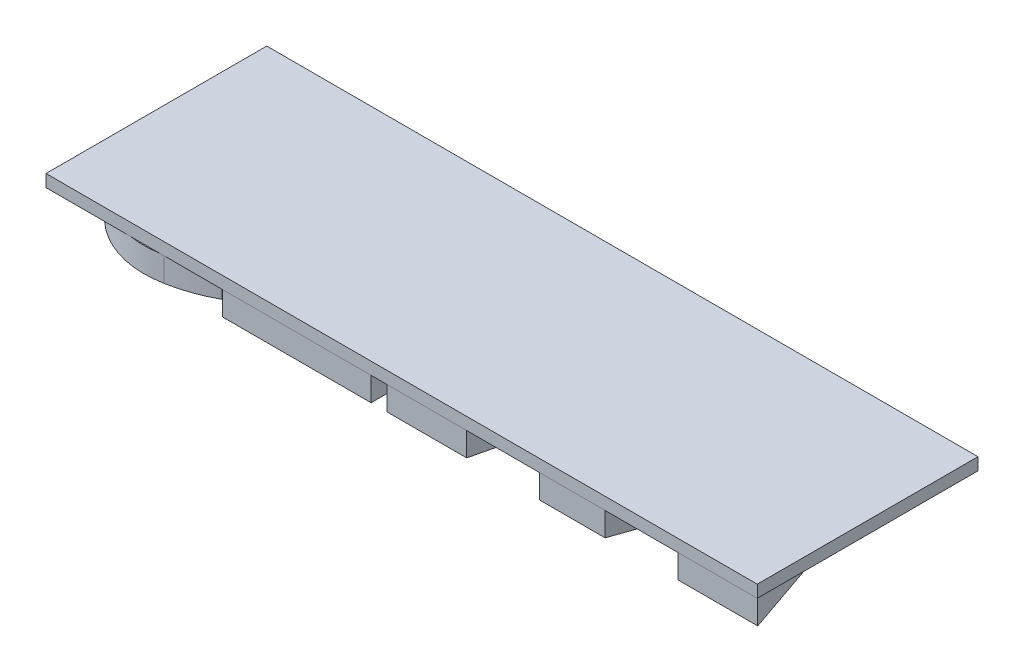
ISO-10303-21;
HEADER;
FILE_DESCRIPTION(('STEP AP214'),'2;1');
FILE_NAME('part.step','',(''),(''),'','','');
FILE_SCHEMA(('AUTOMOTIVE_DESIGN { 1 0 10303 214 1 1 1 1 }'));
ENDSEC;
DATA;
#1=APPLICATION_CONTEXT('core data for automotive mechanical design processes');
#2=APPLICATION_PROTOCOL_DEFINITION('international standard','automotive_design',2000,#1);
#3=PRODUCT_CONTEXT('',#1,'mechanical');
#4=PRODUCT('Part','Part','',(#3));
#5=PRODUCT_RELATED_PRODUCT_CATEGORY('part','',(#4));
#6=PRODUCT_DEFINITION_FORMATION('','',#4);
#7=PRODUCT_DEFINITION_CONTEXT('part definition',#1,'design');
#8=PRODUCT_DEFINITION('design','',#6,#7);
#9=PRODUCT_DEFINITION_SHAPE('','',#8);
#10=(LENGTH_UNIT() NAMED_UNIT(*) SI_UNIT(.MILLI.,.METRE.));
#11=(NAMED_UNIT(*) PLANE_ANGLE_UNIT() SI_UNIT($,.RADIAN.));
#12=(NAMED_UNIT(*) SI_UNIT($,.STERADIAN.) SOLID_ANGLE_UNIT());
#13=UNCERTAINTY_MEASURE_WITH_UNIT(LENGTH_MEASURE(1.E-05),#10,'distance_accuracy_value','');
#14=(GEOMETRIC_REPRESENTATION_CONTEXT(3) GLOBAL_UNCERTAINTY_ASSIGNED_CONTEXT((#13)) GLOBAL_UNIT_ASSIGNED_CONTEXT((#10,
#11,#12)) REPRESENTATION_CONTEXT('',''));
#15=CARTESIAN_POINT('',(0.,0.,0.));
#16=DIRECTION('',(0.,0.,1.));
#17=DIRECTION('',(1.,0.,0.));
#18=AXIS2_PLACEMENT_3D('',#15,#16,#17);
#19=CARTESIAN_POINT('',(573.580606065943,-165.9,-16.423323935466));
#20=DIRECTION('',(0.,1.,0.));
#21=DIRECTION('',(0.,0.,1.));
#22=AXIS2_PLACEMENT_3D('',#19,#20,#21);
#23=CYLINDRICAL_SURFACE('',#22,2.29749016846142);
#24=CARTESIAN_POINT('',(573.580606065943,-165.9,-16.423323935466));
#25=DIRECTION('',(0.,1.,0.));
#26=DIRECTION('',(0.,0.,1.));
#27=AXIS2_PLACEMENT_3D('',#24,#25,#26);
#28=CIRCLE('',#27,2.29749016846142);
#29=CARTESIAN_POINT('',(574.672917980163,-165.9,-18.4445403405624));
#30=VERTEX_POINT('',#29);
#31=CARTESIAN_POINT('',(573.246680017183,-165.9,-18.6964175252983));
#32=VERTEX_POINT('',#31);
#33=EDGE_CURVE('E192',#30,#32,#28,.T.);
#34=ORIENTED_EDGE('',*,*,#33,.F.);
#35=DIRECTION('',(0.,1.,0.));
#36=VECTOR('',#35,1.);
#37=CARTESIAN_POINT('',(574.672917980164,-165.9,-18.4445403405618));
#38=LINE('',#37,#36);
#39=CARTESIAN_POINT('',(574.672917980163,-163.9,-18.4445403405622));
#40=VERTEX_POINT('',#39);
#41=EDGE_CURVE('E190',#30,#40,#38,.T.);
#42=ORIENTED_EDGE('',*,*,#41,.T.);
#43=CARTESIAN_POINT('',(573.580606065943,-163.9,-16.423323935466));
#44=DIRECTION('',(0.,1.,0.));
#45=DIRECTION('',(0.,0.,1.));
#46=AXIS2_PLACEMENT_3D('',#43,#44,#45);
#47=CIRCLE('',#46,2.29749016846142);
#48=CARTESIAN_POINT('',(573.246680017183,-163.9,-18.6964175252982));
#49=VERTEX_POINT('',#48);
#50=EDGE_CURVE('E20',#49,#40,#47,.F.);
#51=ORIENTED_EDGE('',*,*,#50,.F.);
#52=DIRECTION('',(0.,1.,0.));
#53=VECTOR('',#52,1.);
#54=CARTESIAN_POINT('',(573.246680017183,-165.9,-18.6964175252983));
#55=LINE('',#54,#53);
#56=EDGE_CURVE('E196',#49,#32,#55,.F.);
#57=ORIENTED_EDGE('',*,*,#56,.T.);
#58=EDGE_LOOP('',(#34,#42,#51,#57));
#59=FACE_BOUND('',#58,.T.);
#60=ADVANCED_FACE('F16',(#59),#23,.F.);
#61=CARTESIAN_POINT('',(614.36037837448,-165.9,-23.26473661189));
#62=DIRECTION('',(0.,-1.,0.));
#63=DIRECTION('',(0.,0.,-1.));
#64=AXIS2_PLACEMENT_3D('',#61,#62,#63);
#65=PLANE('',#64);
#66=DIRECTION('',(-1.,0.,0.));
#67=VECTOR('',#66,1.);
#68=CARTESIAN_POINT('',(602.238415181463,-165.9,-5.46459066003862));
#69=LINE('',#68,#67);
#70=CARTESIAN_POINT('',(602.238415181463,-165.9,-5.46459066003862));
#71=VERTEX_POINT('',#70);
#72=CARTESIAN_POINT('',(595.730834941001,-165.9,-5.46459066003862));
#73=VERTEX_POINT('',#72);
#74=EDGE_CURVE('E334',#71,#73,#69,.T.);
#75=ORIENTED_EDGE('',*,*,#74,.T.);
#76=DIRECTION('',(0.276115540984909,0.,-0.9611244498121));
#77=VECTOR('',#76,1.);
#78=CARTESIAN_POINT('',(595.730834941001,-165.9,-5.46459066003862));
#79=LINE('',#78,#77);
#80=CARTESIAN_POINT('',(600.844529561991,-165.9,-23.2647366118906));
#81=VERTEX_POINT('',#80);
#82=EDGE_CURVE('E340',#73,#81,#79,.T.);
#83=ORIENTED_EDGE('',*,*,#82,.T.);
#84=DIRECTION('',(1.,0.,0.));
#85=VECTOR('',#84,1.);
#86=CARTESIAN_POINT('',(600.844529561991,-165.9,-23.2647366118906));
#87=LINE('',#86,#85);
#88=CARTESIAN_POINT('',(607.342399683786,-165.9,-23.2647366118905));
#89=VERTEX_POINT('',#88);
#90=EDGE_CURVE('E346',#81,#89,#87,.T.);
#91=ORIENTED_EDGE('',*,*,#90,.T.);
#92=DIRECTION('',(0.326906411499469,0.,0.945056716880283));
#93=VECTOR('',#92,1.);
#94=CARTESIAN_POINT('',(607.342399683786,-165.9,-23.2647366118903));
#95=LINE('',#94,#93);
#96=CARTESIAN_POINT('',(610.851389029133,-165.9,-13.1205674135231));
#97=VERTEX_POINT('',#96);
#98=EDGE_CURVE('E356',#89,#97,#95,.T.);
#99=ORIENTED_EDGE('',*,*,#98,.T.);
#100=DIRECTION('',(0.326906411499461,0.,-0.945056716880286));
#101=VECTOR('',#100,1.);
#102=CARTESIAN_POINT('',(610.851389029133,-165.9,-13.1205674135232));
#103=LINE('',#102,#101);
#104=CARTESIAN_POINT('',(614.36037837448,-165.9,-23.2647366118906));
#105=VERTEX_POINT('',#104);
#106=EDGE_CURVE('E282',#97,#105,#103,.T.);
#107=ORIENTED_EDGE('',*,*,#106,.T.);
#108=DIRECTION('',(1.,0.,0.));
#109=VECTOR('',#108,1.);
#110=CARTESIAN_POINT('',(614.36037837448,-165.9,-23.2647366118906));
#111=LINE('',#110,#109);
#112=CARTESIAN_POINT('',(619.839793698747,-165.9,-23.2647366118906));
#113=VERTEX_POINT('',#112);
#114=EDGE_CURVE('E286',#105,#113,#111,.T.);
#115=ORIENTED_EDGE('',*,*,#114,.T.);
#116=DIRECTION('',(0.325713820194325,0.,0.945468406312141));
#117=VECTOR('',#116,1.);
#118=CARTESIAN_POINT('',(619.839793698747,-165.9,-23.2647366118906));
#119=LINE('',#118,#117);
#120=CARTESIAN_POINT('',(625.971943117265,-165.9,-5.46459066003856));
#121=VERTEX_POINT('',#120);
#122=EDGE_CURVE('E292',#113,#121,#119,.T.);
#123=ORIENTED_EDGE('',*,*,#122,.T.);
#124=DIRECTION('',(-1.,0.,0.));
#125=VECTOR('',#124,1.);
#126=CARTESIAN_POINT('',(625.971943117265,-165.9,-5.46459066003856));
#127=LINE('',#126,#125);
#128=CARTESIAN_POINT('',(619.464362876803,-165.9,-5.46459066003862));
#129=VERTEX_POINT('',#128);
#130=EDGE_CURVE('E298',#121,#129,#127,.T.);
#131=ORIENTED_EDGE('',*,*,#130,.T.);
#132=DIRECTION('',(-0.232447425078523,0.,-0.972608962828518));
#133=VECTOR('',#132,1.);
#134=CARTESIAN_POINT('',(619.464362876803,-165.9,-5.46459066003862));
#135=LINE('',#134,#133);
#136=CARTESIAN_POINT('',(617.0399702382,-165.9,-15.6087598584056));
#137=VERTEX_POINT('',#136);
#138=EDGE_CURVE('E304',#129,#137,#135,.T.);
#139=ORIENTED_EDGE('',*,*,#138,.T.);
#140=DIRECTION('',(-0.326906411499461,0.,0.945056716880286));
#141=VECTOR('',#140,1.);
#142=CARTESIAN_POINT('',(617.0399702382,-165.9,-15.6087598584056));
#143=LINE('',#142,#141);
#144=CARTESIAN_POINT('',(613.530980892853,-165.9,-5.46459066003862));
#145=VERTEX_POINT('',#144);
#146=EDGE_CURVE('E310',#137,#145,#143,.T.);
#147=ORIENTED_EDGE('',*,*,#146,.T.);
#148=DIRECTION('',(1.,0.,0.));
#149=VECTOR('',#148,1.);
#150=CARTESIAN_POINT('',(613.530980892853,-165.9,-5.46459066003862));
#151=LINE('',#150,#149);
#152=CARTESIAN_POINT('',(608.171797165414,-165.9,-5.46459066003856));
#153=VERTEX_POINT('',#152);
#154=EDGE_CURVE('E316',#145,#153,#151,.F.);
#155=ORIENTED_EDGE('',*,*,#154,.T.);
#156=DIRECTION('',(-0.326906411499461,0.,-0.945056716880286));
#157=VECTOR('',#156,1.);
#158=CARTESIAN_POINT('',(608.171797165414,-165.9,-5.46459066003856));
#159=LINE('',#158,#157);
#160=CARTESIAN_POINT('',(604.662807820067,-165.9,-15.6087598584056));
#161=VERTEX_POINT('',#160);
#162=EDGE_CURVE('E322',#153,#161,#159,.T.);
#163=ORIENTED_EDGE('',*,*,#162,.T.);
#164=DIRECTION('',(-0.232447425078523,0.,0.972608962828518));
#165=VECTOR('',#164,1.);
#166=CARTESIAN_POINT('',(604.662807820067,-165.9,-15.6087598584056));
#167=LINE('',#166,#165);
#168=EDGE_CURVE('E328',#161,#71,#167,.T.);
#169=ORIENTED_EDGE('',*,*,#168,.T.);
#170=EDGE_LOOP('',(#75,#83,#91,#99,#107,#115,#123,#131,#139,#147,#155,#163,#169));
#171=FACE_BOUND('',#170,.T.);
#172=ADVANCED_FACE('F943',(#171),#65,.T.);
#173=CARTESIAN_POINT('',(588.712856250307,-165.9,-12.0852725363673));
#174=DIRECTION('',(-1.,0.,0.));
#175=DIRECTION('',(0.,0.,1.));
#176=AXIS2_PLACEMENT_3D('',#173,#174,#175);
#177=PLANE('',#176);
#178=DIRECTION('',(0.,0.,1.));
#179=VECTOR('',#178,1.);
#180=CARTESIAN_POINT('',(588.712856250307,-165.9,-12.0865927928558));
#181=LINE('',#180,#179);
#182=CARTESIAN_POINT('',(588.712856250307,-165.9,-10.4264775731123));
#183=VERTEX_POINT('',#182);
#184=CARTESIAN_POINT('',(588.712856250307,-165.9,-12.0852725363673));
#185=VERTEX_POINT('',#184);
#186=EDGE_CURVE('E266',#183,#185,#181,.F.);
#187=ORIENTED_EDGE('',*,*,#186,.T.);
#188=DIRECTION('',(0.,1.,0.));
#189=VECTOR('',#188,1.);
#190=CARTESIAN_POINT('',(588.712856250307,-165.9,-12.0852725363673));
#191=LINE('',#190,#189);
#192=CARTESIAN_POINT('',(588.712856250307,-163.9,-12.0852725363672));
#193=VERTEX_POINT('',#192);
#194=EDGE_CURVE('E361',#185,#193,#191,.T.);
#195=ORIENTED_EDGE('',*,*,#194,.T.);
#196=DIRECTION('',(0.,0.,1.));
#197=VECTOR('',#196,1.);
#198=CARTESIAN_POINT('',(588.712856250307,-163.9,-12.0852725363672));
#199=LINE('',#198,#197);
#200=CARTESIAN_POINT('',(588.712856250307,-163.9,-10.4264775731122));
#201=VERTEX_POINT('',#200);
#202=EDGE_CURVE('E188',#201,#193,#199,.F.);
#203=ORIENTED_EDGE('',*,*,#202,.F.);
#204=DIRECTION('',(0.,1.,0.));
#205=VECTOR('',#204,1.);
#206=CARTESIAN_POINT('',(588.712856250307,-165.9,-10.4264775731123));
#207=LINE('',#206,#205);
#208=EDGE_CURVE('E363',#201,#183,#207,.F.);
#209=ORIENTED_EDGE('',*,*,#208,.T.);
#210=EDGE_LOOP('',(#187,#195,#203,#209));
#211=FACE_BOUND('',#210,.T.);
#212=ADVANCED_FACE('F937',(#211),#177,.F.);
#213=CARTESIAN_POINT('',(593.689241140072,-165.9,-12.0865927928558));
#214=DIRECTION('',(0.,1.,0.));
#215=DIRECTION('',(0.,0.,1.));
#216=AXIS2_PLACEMENT_3D('',#213,#214,#215);
#217=PLANE('',#216);
#218=DIRECTION('',(0.999535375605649,0.,0.0304800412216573));
#219=VECTOR('',#218,1.);
#220=CARTESIAN_POINT('',(588.712856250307,-165.9,-10.4264775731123));
#221=LINE('',#220,#219);
#222=CARTESIAN_POINT('',(594.393808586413,-165.9,-10.2532414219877));
#223=VERTEX_POINT('',#222);
#224=EDGE_CURVE('E365',#183,#223,#221,.T.);
#225=ORIENTED_EDGE('',*,*,#224,.T.);
#226=DIRECTION('',(0.01274373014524,0.,0.999918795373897));
#227=VECTOR('',#226,1.);
#228=CARTESIAN_POINT('',(594.393808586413,-165.9,-10.2532414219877));
#229=LINE('',#228,#227);
#230=CARTESIAN_POINT('',(594.454838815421,-165.9,-5.46459066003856));
#231=VERTEX_POINT('',#230);
#232=EDGE_CURVE('E370',#223,#231,#229,.T.);
#233=ORIENTED_EDGE('',*,*,#232,.T.);
#234=DIRECTION('',(-1.,0.,0.));
#235=VECTOR('',#234,1.);
#236=CARTESIAN_POINT('',(594.454838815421,-165.9,-5.46459066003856));
#237=LINE('',#236,#235);
#238=CARTESIAN_POINT('',(582.332875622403,-165.9,-5.46459066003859));
#239=VERTEX_POINT('',#238);
#240=EDGE_CURVE('E376',#231,#239,#237,.T.);
#241=ORIENTED_EDGE('',*,*,#240,.T.);
#242=DIRECTION('',(0.,0.,1.));
#243=VECTOR('',#242,1.);
#244=CARTESIAN_POINT('',(582.332875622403,-165.9,-5.46459066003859));
#245=LINE('',#244,#243);
#246=CARTESIAN_POINT('',(582.332875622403,-165.9,-23.2647366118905));
#247=VERTEX_POINT('',#246);
#248=EDGE_CURVE('E382',#239,#247,#245,.F.);
#249=ORIENTED_EDGE('',*,*,#248,.T.);
#250=DIRECTION('',(1.,0.,0.));
#251=VECTOR('',#250,1.);
#252=CARTESIAN_POINT('',(582.332875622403,-165.9,-23.2647366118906));
#253=LINE('',#252,#251);
#254=CARTESIAN_POINT('',(594.22798013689,-165.9,-23.2647366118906));
#255=VERTEX_POINT('',#254);
#256=EDGE_CURVE('E388',#247,#255,#253,.T.);
#257=ORIENTED_EDGE('',*,*,#256,.T.);
#258=DIRECTION('',(0.0127437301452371,0.,0.999918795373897));
#259=VECTOR('',#258,1.);
#260=CARTESIAN_POINT('',(594.22798013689,-165.9,-23.2647366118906));
#261=LINE('',#260,#259);
#262=CARTESIAN_POINT('',(594.289010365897,-165.9,-18.4760858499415));
#263=VERTEX_POINT('',#262);
#264=EDGE_CURVE('E394',#255,#263,#261,.T.);
#265=ORIENTED_EDGE('',*,*,#264,.T.);
#266=DIRECTION('',(1.,0.,0.));
#267=VECTOR('',#266,1.);
#268=CARTESIAN_POINT('',(594.289010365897,-165.9,-18.4760858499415));
#269=LINE('',#268,#267);
#270=CARTESIAN_POINT('',(588.712856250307,-165.9,-18.4760858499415));
#271=VERTEX_POINT('',#270);
#272=EDGE_CURVE('E400',#263,#271,#269,.F.);
#273=ORIENTED_EDGE('',*,*,#272,.T.);
#274=DIRECTION('',(0.,0.,1.));
#275=VECTOR('',#274,1.);
#276=CARTESIAN_POINT('',(588.712856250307,-165.9,-18.4760858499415));
#277=LINE('',#276,#275);
#278=CARTESIAN_POINT('',(588.712856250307,-165.9,-16.5002631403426));
#279=VERTEX_POINT('',#278);
#280=EDGE_CURVE('E406',#271,#279,#277,.T.);
#281=ORIENTED_EDGE('',*,*,#280,.T.);
#282=DIRECTION('',(0.999999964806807,0.,0.000265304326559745));
#283=VECTOR('',#282,1.);
#284=CARTESIAN_POINT('',(588.712856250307,-165.9,-16.5002631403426));
#285=LINE('',#284,#283);
#286=CARTESIAN_POINT('',(593.689241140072,-165.9,-16.4989428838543));
#287=VERTEX_POINT('',#286);
#288=EDGE_CURVE('E412',#279,#287,#285,.T.);
#289=ORIENTED_EDGE('',*,*,#288,.T.);
#290=DIRECTION('',(0.,0.,1.));
#291=VECTOR('',#290,1.);
#292=CARTESIAN_POINT('',(593.689241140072,-165.9,-16.4989428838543));
#293=LINE('',#292,#291);
#294=CARTESIAN_POINT('',(593.689241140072,-165.9,-12.0865927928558));
#295=VERTEX_POINT('',#294);
#296=EDGE_CURVE('E420',#287,#295,#293,.T.);
#297=ORIENTED_EDGE('',*,*,#296,.T.);
#298=DIRECTION('',(-0.999999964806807,0.,0.000265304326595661));
#299=VECTOR('',#298,1.);
#300=CARTESIAN_POINT('',(593.689241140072,-165.9,-12.0865927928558));
#301=LINE('',#300,#299);
#302=EDGE_CURVE('E355',#295,#185,#301,.T.);
#303=ORIENTED_EDGE('',*,*,#302,.T.);
#304=ORIENTED_EDGE('',*,*,#186,.F.);
#305=EDGE_LOOP('',(#225,#233,#241,#249,#257,#265,#273,#281,#289,#297,#303,#304));
#306=FACE_BOUND('',#305,.T.);
#307=ADVANCED_FACE('F932',(#306),#217,.F.);
#308=CARTESIAN_POINT('',(574.830696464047,-165.9,-10.607078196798));
#309=DIRECTION('',(0.,1.,0.));
#310=DIRECTION('',(0.,0.,1.));
#311=AXIS2_PLACEMENT_3D('',#308,#309,#310);
#312=CYLINDRICAL_SURFACE('',#311,0.840342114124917);
#313=CARTESIAN_POINT('',(574.830696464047,-165.9,-10.607078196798));
#314=DIRECTION('',(0.,1.,0.));
#315=DIRECTION('',(0.,0.,1.));
#316=AXIS2_PLACEMENT_3D('',#313,#314,#315);
#317=CIRCLE('',#316,0.840342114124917);
#318=CARTESIAN_POINT('',(574.135377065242,-165.9,-11.0789953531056));
#319=VERTEX_POINT('',#318);
#320=CARTESIAN_POINT('',(574.331772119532,-165.9,-9.93087603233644));
#321=VERTEX_POINT('',#320);
#322=EDGE_CURVE('E263',#319,#321,#317,.T.);
#323=ORIENTED_EDGE('',*,*,#322,.F.);
#324=DIRECTION('',(0.,1.,0.));
#325=VECTOR('',#324,1.);
#326=CARTESIAN_POINT('',(574.135377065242,-165.9,-11.0789953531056));
#327=LINE('',#326,#325);
#328=CARTESIAN_POINT('',(574.135377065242,-163.9,-11.0789953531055));
#329=VERTEX_POINT('',#328);
#330=EDGE_CURVE('E590',#319,#329,#327,.T.);
#331=ORIENTED_EDGE('',*,*,#330,.T.);
#332=CARTESIAN_POINT('',(574.830696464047,-163.9,-10.6070781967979));
#333=DIRECTION('',(0.,1.,0.));
#334=DIRECTION('',(0.,0.,1.));
#335=AXIS2_PLACEMENT_3D('',#332,#333,#334);
#336=CIRCLE('',#335,0.840342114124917);
#337=CARTESIAN_POINT('',(574.331772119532,-163.9,-9.93087603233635));
#338=VERTEX_POINT('',#337);
#339=EDGE_CURVE('E265',#338,#329,#336,.F.);
#340=ORIENTED_EDGE('',*,*,#339,.F.);
#341=DIRECTION('',(0.,1.,0.));
#342=VECTOR('',#341,1.);
#343=CARTESIAN_POINT('',(574.331772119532,-165.9,-9.93087603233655));
#344=LINE('',#343,#342);
#345=EDGE_CURVE('E229',#338,#321,#344,.F.);
#346=ORIENTED_EDGE('',*,*,#345,.T.);
#347=EDGE_LOOP('',(#323,#331,#340,#346));
#348=FACE_BOUND('',#347,.T.);
#349=ADVANCED_FACE('F693',(#348),#312,.F.);
#350=CARTESIAN_POINT('',(567.653784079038,-165.9,-28.9625458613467));
#351=DIRECTION('',(0.,-1.,0.));
#352=DIRECTION('',(0.,0.,-1.));
#353=AXIS2_PLACEMENT_3D('',#350,#351,#352);
#354=PLANE('',#353);
#355=CARTESIAN_POINT('',(576.893338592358,-165.9,-15.9102363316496));
#356=DIRECTION('',(0.,1.,0.));
#357=DIRECTION('',(0.,0.,1.));
#358=AXIS2_PLACEMENT_3D('',#355,#356,#357);
#359=CIRCLE('',#358,3.58583469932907);
#360=CARTESIAN_POINT('',(577.292705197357,-165.9,-12.3467104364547));
#361=VERTEX_POINT('',#360);
#362=CARTESIAN_POINT('',(580.413802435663,-165.9,-15.228661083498));
#363=VERTEX_POINT('',#362);
#364=EDGE_CURVE('E230',#361,#363,#359,.T.);
#365=ORIENTED_EDGE('',*,*,#364,.F.);
#366=DIRECTION('',(-0.927991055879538,0.,0.372602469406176));
#367=VECTOR('',#366,1.);
#368=CARTESIAN_POINT('',(577.292705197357,-165.9,-12.3467104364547));
#369=LINE('',#368,#367);
#370=EDGE_CURVE('E594',#361,#319,#369,.T.);
#371=ORIENTED_EDGE('',*,*,#370,.T.);
#372=ORIENTED_EDGE('',*,*,#322,.T.);
#373=CARTESIAN_POINT('',(575.385938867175,-165.9,-12.7255719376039));
#374=DIRECTION('',(0.,1.,0.));
#375=DIRECTION('',(0.,0.,1.));
#376=AXIS2_PLACEMENT_3D('',#373,#374,#375);
#377=CIRCLE('',#376,2.98690353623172);
#378=CARTESIAN_POINT('',(577.292705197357,-165.9,-10.4264775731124));
#379=VERTEX_POINT('',#378);
#380=EDGE_CURVE('E227',#321,#379,#377,.T.);
#381=ORIENTED_EDGE('',*,*,#380,.T.);
#382=CARTESIAN_POINT('',(567.653784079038,-165.9,-28.9625458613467));
#383=DIRECTION('',(0.,1.,0.));
#384=DIRECTION('',(0.,0.,1.));
#385=AXIS2_PLACEMENT_3D('',#382,#383,#384);
#386=CIRCLE('',#385,20.8924538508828);
#387=CARTESIAN_POINT('',(578.866461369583,-165.9,-11.333861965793));
#388=VERTEX_POINT('',#387);
#389=EDGE_CURVE('E223',#379,#388,#386,.T.);
#390=ORIENTED_EDGE('',*,*,#389,.T.);
#391=DIRECTION('',(0.425811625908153,0.,0.904811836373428));
#392=VECTOR('',#391,1.);
#393=CARTESIAN_POINT('',(578.866461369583,-165.9,-11.333861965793));
#394=LINE('',#393,#392);
#395=CARTESIAN_POINT('',(581.056879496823,-165.9,-6.6794182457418));
#396=VERTEX_POINT('',#395);
#397=EDGE_CURVE('E222',#388,#396,#394,.T.);
#398=ORIENTED_EDGE('',*,*,#397,.T.);
#399=CARTESIAN_POINT('',(575.62137173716,-165.9,-16.5800647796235));
#400=DIRECTION('',(0.,1.,0.));
#401=DIRECTION('',(0.,0.,1.));
#402=AXIS2_PLACEMENT_3D('',#399,#400,#401);
#403=CIRCLE('',#402,11.2945803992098);
#404=CARTESIAN_POINT('',(577.556703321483,-165.9,-5.45252965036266));
#405=VERTEX_POINT('',#404);
#406=EDGE_CURVE('E218',#405,#396,#403,.T.);
#407=ORIENTED_EDGE('',*,*,#406,.F.);
#408=CARTESIAN_POINT('',(576.074669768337,-165.9,-13.0567676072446));
#409=DIRECTION('',(0.,1.,0.));
#410=DIRECTION('',(0.,0.,1.));
#411=AXIS2_PLACEMENT_3D('',#408,#409,#410);
#412=CIRCLE('',#411,7.74731297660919);
#413=CARTESIAN_POINT('',(569.765776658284,-165.9,-8.56024382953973));
#414=VERTEX_POINT('',#413);
#415=EDGE_CURVE('E250',#414,#405,#412,.T.);
#416=ORIENTED_EDGE('',*,*,#415,.F.);
#417=CARTESIAN_POINT('',(573.442679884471,-165.9,-11.6871840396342));
#418=DIRECTION('',(0.,1.,0.));
#419=DIRECTION('',(0.,0.,1.));
#420=AXIS2_PLACEMENT_3D('',#417,#418,#419);
#421=CIRCLE('',#420,4.82673517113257);
#422=CARTESIAN_POINT('',(572.511899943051,-165.9,-16.4233239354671));
#423=VERTEX_POINT('',#422);
#424=EDGE_CURVE('E258',#423,#414,#421,.T.);
#425=ORIENTED_EDGE('',*,*,#424,.F.);
#426=DIRECTION('',(0.970991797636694,0.,-0.239112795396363));
#427=VECTOR('',#426,1.);
#428=CARTESIAN_POINT('',(572.511899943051,-165.9,-16.4233239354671));
#429=LINE('',#428,#427);
#430=CARTESIAN_POINT('',(574.579194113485,-165.9,-16.9324080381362));
#431=VERTEX_POINT('',#430);
#432=EDGE_CURVE('E606',#423,#431,#429,.T.);
#433=ORIENTED_EDGE('',*,*,#432,.T.);
#434=CARTESIAN_POINT('',(574.331772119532,-165.9,-17.7067142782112));
#435=DIRECTION('',(0.,1.,0.));
#436=DIRECTION('',(0.,0.,1.));
#437=AXIS2_PLACEMENT_3D('',#434,#435,#436);
#438=CIRCLE('',#437,0.812876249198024);
#439=EDGE_CURVE('E197',#431,#30,#438,.T.);
#440=ORIENTED_EDGE('',*,*,#439,.T.);
#441=ORIENTED_EDGE('',*,*,#33,.T.);
#442=CARTESIAN_POINT('',(575.398000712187,-165.9,-7.64607320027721));
#443=DIRECTION('',(0.,1.,0.));
#444=DIRECTION('',(0.,0.,1.));
#445=AXIS2_PLACEMENT_3D('',#442,#443,#444);
#446=CIRCLE('',#445,11.2578101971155);
#447=CARTESIAN_POINT('',(568.843174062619,-165.9,-16.7988071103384));
#448=VERTEX_POINT('',#447);
#449=EDGE_CURVE('E254',#32,#448,#446,.T.);
#450=ORIENTED_EDGE('',*,*,#449,.T.);
#451=DIRECTION('',(-0.189131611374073,0.,-0.981951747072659));
#452=VECTOR('',#451,1.);
#453=CARTESIAN_POINT('',(568.843174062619,-165.9,-16.7988071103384));
#454=LINE('',#453,#452);
#455=CARTESIAN_POINT('',(567.914119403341,-165.9,-21.6223627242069));
#456=VERTEX_POINT('',#455);
#457=EDGE_CURVE('E253',#448,#456,#454,.T.);
#458=ORIENTED_EDGE('',*,*,#457,.T.);
#459=CARTESIAN_POINT('',(575.204352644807,-165.9,-6.75942256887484));
#460=DIRECTION('',(0.,1.,0.));
#461=DIRECTION('',(0.,0.,1.));
#462=AXIS2_PLACEMENT_3D('',#459,#460,#461);
#463=CIRCLE('',#462,16.5545912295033);
#464=CARTESIAN_POINT('',(573.92799097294,-165.9,-23.2647366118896));
#465=VERTEX_POINT('',#464);
#466=EDGE_CURVE('E243',#465,#456,#463,.T.);
#467=ORIENTED_EDGE('',*,*,#466,.F.);
#468=CARTESIAN_POINT('',(573.628991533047,-165.9,-15.1833422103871));
#469=DIRECTION('',(0.,1.,0.));
#470=DIRECTION('',(0.,0.,1.));
#471=AXIS2_PLACEMENT_3D('',#468,#469,#470);
#472=CIRCLE('',#471,8.08692377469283);
#473=CARTESIAN_POINT('',(580.037168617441,-165.9,-20.1162523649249));
#474=VERTEX_POINT('',#473);
#475=EDGE_CURVE('E239',#474,#465,#472,.T.);
#476=ORIENTED_EDGE('',*,*,#475,.F.);
#477=CARTESIAN_POINT('',(575.449623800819,-165.9,-17.3044326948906));
#478=DIRECTION('',(0.,1.,0.));
#479=DIRECTION('',(0.,0.,1.));
#480=AXIS2_PLACEMENT_3D('',#477,#478,#479);
#481=CIRCLE('',#480,5.38069673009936);
#482=EDGE_CURVE('E235',#363,#474,#481,.T.);
#483=ORIENTED_EDGE('',*,*,#482,.F.);
#484=EDGE_LOOP('',(#365,#371,#372,#381,#390,#398,#407,#416,#425,#433,#440,#441,#450,#458,#467,
#476,#483));
#485=FACE_BOUND('',#484,.T.);
#486=ADVANCED_FACE('F668',(#485),#354,.T.);
#487=CARTESIAN_POINT('',(573.442679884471,-165.9,-11.6871840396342));
#488=DIRECTION('',(0.,1.,0.));
#489=DIRECTION('',(0.,0.,1.));
#490=AXIS2_PLACEMENT_3D('',#487,#488,#489);
#491=CYLINDRICAL_SURFACE('',#490,4.82673517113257);
#492=CARTESIAN_POINT('',(573.442679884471,-163.9,-11.6871840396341));
#493=DIRECTION('',(0.,1.,0.));
#494=DIRECTION('',(0.,0.,1.));
#495=AXIS2_PLACEMENT_3D('',#492,#493,#494);
#496=CIRCLE('',#495,4.82673517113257);
#497=CARTESIAN_POINT('',(569.765776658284,-163.9,-8.56024382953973));
#498=VERTEX_POINT('',#497);
#499=CARTESIAN_POINT('',(572.511899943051,-163.9,-16.4233239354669));
#500=VERTEX_POINT('',#499);
#501=EDGE_CURVE('E207',#498,#500,#496,.F.);
#502=ORIENTED_EDGE('',*,*,#501,.T.);
#503=DIRECTION('',(0.,1.,0.));
#504=VECTOR('',#503,1.);
#505=CARTESIAN_POINT('',(572.511899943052,-165.9,-16.423323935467));
#506=LINE('',#505,#504);
#507=EDGE_CURVE('E261',#500,#423,#506,.F.);
#508=ORIENTED_EDGE('',*,*,#507,.T.);
#509=ORIENTED_EDGE('',*,*,#424,.T.);
#510=DIRECTION('',(0.,1.,0.));
#511=VECTOR('',#510,1.);
#512=CARTESIAN_POINT('',(569.765776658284,-165.9,-8.56024382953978));
#513=LINE('',#512,#511);
#514=EDGE_CURVE('E249',#498,#414,#513,.F.);
#515=ORIENTED_EDGE('',*,*,#514,.F.);
#516=EDGE_LOOP('',(#502,#508,#509,#515));
#517=FACE_BOUND('',#516,.T.);
#518=ADVANCED_FACE('F674',(#517),#491,.T.);
#519=CARTESIAN_POINT('',(572.511899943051,-165.9,-16.4233239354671));
#520=DIRECTION('',(0.239112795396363,0.,0.970991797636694));
#521=DIRECTION('',(0.970991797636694,0.,-0.239112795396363));
#522=AXIS2_PLACEMENT_3D('',#519,#520,#521);
#523=PLANE('',#522);
#524=ORIENTED_EDGE('',*,*,#432,.F.);
#525=ORIENTED_EDGE('',*,*,#507,.F.);
#526=DIRECTION('',(0.970991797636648,0.,-0.239112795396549));
#527=VECTOR('',#526,1.);
#528=CARTESIAN_POINT('',(572.511899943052,-163.9,-16.423323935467));
#529=LINE('',#528,#527);
#530=CARTESIAN_POINT('',(574.579194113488,-163.9,-16.9324080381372));
#531=VERTEX_POINT('',#530);
#532=EDGE_CURVE('E203',#500,#531,#529,.T.);
#533=ORIENTED_EDGE('',*,*,#532,.T.);
#534=DIRECTION('',(0.,1.,0.));
#535=VECTOR('',#534,1.);
#536=CARTESIAN_POINT('',(574.579194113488,-165.9,-16.9324080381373));
#537=LINE('',#536,#535);
#538=EDGE_CURVE('E202',#531,#431,#537,.F.);
#539=ORIENTED_EDGE('',*,*,#538,.T.);
#540=EDGE_LOOP('',(#524,#525,#533,#539));
#541=FACE_BOUND('',#540,.T.);
#542=ADVANCED_FACE('F672',(#541),#523,.F.);
#543=CARTESIAN_POINT('',(574.331772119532,-165.9,-17.7067142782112));
#544=DIRECTION('',(0.,1.,0.));
#545=DIRECTION('',(0.,0.,1.));
#546=AXIS2_PLACEMENT_3D('',#543,#544,#545);
#547=CYLINDRICAL_SURFACE('',#546,0.812876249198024);
#548=ORIENTED_EDGE('',*,*,#439,.F.);
#549=ORIENTED_EDGE('',*,*,#538,.F.);
#550=CARTESIAN_POINT('',(574.331772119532,-163.9,-17.7067142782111));
#551=DIRECTION('',(0.,1.,0.));
#552=DIRECTION('',(0.,0.,1.));
#553=AXIS2_PLACEMENT_3D('',#550,#551,#552);
#554=CIRCLE('',#553,0.812876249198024);
#555=EDGE_CURVE('E185',#531,#40,#554,.T.);
#556=ORIENTED_EDGE('',*,*,#555,.T.);
#557=ORIENTED_EDGE('',*,*,#41,.F.);
#558=EDGE_LOOP('',(#548,#549,#556,#557));
#559=FACE_BOUND('',#558,.T.);
#560=ADVANCED_FACE('F200',(#559),#547,.F.);
#561=CARTESIAN_POINT('',(575.398000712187,-165.9,-7.64607320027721));
#562=DIRECTION('',(0.,1.,0.));
#563=DIRECTION('',(0.,0.,1.));
#564=AXIS2_PLACEMENT_3D('',#561,#562,#563);
#565=CYLINDRICAL_SURFACE('',#564,11.2578101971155);
#566=ORIENTED_EDGE('',*,*,#449,.F.);
#567=ORIENTED_EDGE('',*,*,#56,.F.);
#568=CARTESIAN_POINT('',(575.398000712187,-163.9,-7.64607320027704));
#569=DIRECTION('',(0.,1.,0.));
#570=DIRECTION('',(0.,0.,1.));
#571=AXIS2_PLACEMENT_3D('',#568,#569,#570);
#572=CIRCLE('',#571,11.2578101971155);
#573=CARTESIAN_POINT('',(568.843174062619,-163.9,-16.7988071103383));
#574=VERTEX_POINT('',#573);
#575=EDGE_CURVE('E187',#49,#574,#572,.T.);
#576=ORIENTED_EDGE('',*,*,#575,.T.);
#577=DIRECTION('',(0.,1.,0.));
#578=VECTOR('',#577,1.);
#579=CARTESIAN_POINT('',(568.843174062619,-165.9,-16.7988071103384));
#580=LINE('',#579,#578);
#581=EDGE_CURVE('E256',#574,#448,#580,.F.);
#582=ORIENTED_EDGE('',*,*,#581,.T.);
#583=EDGE_LOOP('',(#566,#567,#576,#582));
#584=FACE_BOUND('',#583,.T.);
#585=ADVANCED_FACE('F666',(#584),#565,.F.);
#586=CARTESIAN_POINT('',(568.843174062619,-165.9,-16.7988071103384));
#587=DIRECTION('',(0.981951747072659,0.,-0.189131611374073));
#588=DIRECTION('',(-0.189131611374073,0.,-0.981951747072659));
#589=AXIS2_PLACEMENT_3D('',#586,#587,#588);
#590=PLANE('',#589);
#591=DIRECTION('',(0.,1.,0.));
#592=VECTOR('',#591,1.);
#593=CARTESIAN_POINT('',(567.914119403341,-165.9,-21.6223627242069));
#594=LINE('',#593,#592);
#595=CARTESIAN_POINT('',(567.914119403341,-163.9,-21.6223627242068));
#596=VERTEX_POINT('',#595);
#597=EDGE_CURVE('E242',#456,#596,#594,.T.);
#598=ORIENTED_EDGE('',*,*,#597,.F.);
#599=ORIENTED_EDGE('',*,*,#457,.F.);
#600=ORIENTED_EDGE('',*,*,#581,.F.);
#601=DIRECTION('',(-0.189131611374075,0.,-0.981951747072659));
#602=VECTOR('',#601,1.);
#603=CARTESIAN_POINT('',(568.843174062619,-163.9,-16.7988071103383));
#604=LINE('',#603,#602);
#605=CARTESIAN_POINT('',(568.,-163.9,-21.1764795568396));
#606=VERTEX_POINT('',#605);
#607=EDGE_CURVE('E205',#574,#606,#604,.T.);
#608=ORIENTED_EDGE('',*,*,#607,.T.);
#609=DIRECTION('',(-0.189131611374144,0.,-0.981951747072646));
#610=VECTOR('',#609,1.);
#611=CARTESIAN_POINT('',(568.,-163.9,-21.1764795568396));
#612=LINE('',#611,#610);
#613=EDGE_CURVE('E217',#606,#596,#612,.T.);
#614=ORIENTED_EDGE('',*,*,#613,.T.);
#615=EDGE_LOOP('',(#598,#599,#600,#608,#614));
#616=FACE_BOUND('',#615,.T.);
#617=ADVANCED_FACE('F662',(#616),#590,.F.);
#618=CARTESIAN_POINT('',(576.074669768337,-165.9,-13.0567676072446));
#619=DIRECTION('',(0.,1.,0.));
#620=DIRECTION('',(0.,0.,1.));
#621=AXIS2_PLACEMENT_3D('',#618,#619,#620);
#622=CYLINDRICAL_SURFACE('',#621,7.74731297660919);
#623=CARTESIAN_POINT('',(576.074669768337,-163.9,-13.0567676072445));
#624=DIRECTION('',(0.,1.,0.));
#625=DIRECTION('',(0.,0.,1.));
#626=AXIS2_PLACEMENT_3D('',#623,#624,#625);
#627=CIRCLE('',#626,7.74731297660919);
#628=CARTESIAN_POINT('',(574.893666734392,-163.9,-5.39999999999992));
#629=VERTEX_POINT('',#628);
#630=EDGE_CURVE('E212',#629,#498,#627,.F.);
#631=ORIENTED_EDGE('',*,*,#630,.T.);
#632=ORIENTED_EDGE('',*,*,#514,.T.);
#633=ORIENTED_EDGE('',*,*,#415,.T.);
#634=DIRECTION('',(0.,1.,0.));
#635=VECTOR('',#634,1.);
#636=CARTESIAN_POINT('',(577.556703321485,-165.9,-5.45252965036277));
#637=LINE('',#636,#635);
#638=CARTESIAN_POINT('',(577.556703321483,-163.9,-5.45252965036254));
#639=VERTEX_POINT('',#638);
#640=EDGE_CURVE('E553',#639,#405,#637,.F.);
#641=ORIENTED_EDGE('',*,*,#640,.F.);
#642=CARTESIAN_POINT('',(576.074669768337,-163.9,-13.0567676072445));
#643=DIRECTION('',(0.,1.,0.));
#644=DIRECTION('',(0.,0.,1.));
#645=AXIS2_PLACEMENT_3D('',#642,#643,#644);
#646=CIRCLE('',#645,7.74731297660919);
#647=CARTESIAN_POINT('',(577.255672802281,-163.9,-5.3999999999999));
#648=VERTEX_POINT('',#647);
#649=EDGE_CURVE('E247',#639,#648,#646,.F.);
#650=ORIENTED_EDGE('',*,*,#649,.T.);
#651=CARTESIAN_POINT('',(576.074669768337,-163.9,-13.0567676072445));
#652=DIRECTION('',(0.,1.,0.));
#653=DIRECTION('',(0.,0.,1.));
#654=AXIS2_PLACEMENT_3D('',#651,#652,#653);
#655=CIRCLE('',#654,7.74731297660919);
#656=EDGE_CURVE('E426',#648,#629,#655,.F.);
#657=ORIENTED_EDGE('',*,*,#656,.T.);
#658=EDGE_LOOP('',(#631,#632,#633,#641,#650,#657));
#659=FACE_BOUND('',#658,.T.);
#660=ADVANCED_FACE('F630',(#659),#622,.T.);
#661=CARTESIAN_POINT('',(610.851389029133,-165.9,-13.1205674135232));
#662=DIRECTION('',(0.945056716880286,0.,0.326906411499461));
#663=DIRECTION('',(0.326906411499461,0.,-0.945056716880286));
#664=AXIS2_PLACEMENT_3D('',#661,#662,#663);
#665=PLANE('',#664);
#666=ORIENTED_EDGE('',*,*,#106,.F.);
#667=DIRECTION('',(0.,1.,0.));
#668=VECTOR('',#667,1.);
#669=CARTESIAN_POINT('',(610.851389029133,-165.9,-13.1205674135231));
#670=LINE('',#669,#668);
#671=CARTESIAN_POINT('',(610.851389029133,-163.9,-13.1205674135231));
#672=VERTEX_POINT('',#671);
#673=EDGE_CURVE('E352',#97,#672,#670,.T.);
#674=ORIENTED_EDGE('',*,*,#673,.T.);
#675=DIRECTION('',(0.326906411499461,0.,-0.945056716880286));
#676=VECTOR('',#675,1.);
#677=CARTESIAN_POINT('',(610.851389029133,-163.9,-13.120567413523));
#678=LINE('',#677,#676);
#679=CARTESIAN_POINT('',(614.36037837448,-163.9,-23.2647366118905));
#680=VERTEX_POINT('',#679);
#681=EDGE_CURVE('E508',#672,#680,#678,.T.);
#682=ORIENTED_EDGE('',*,*,#681,.T.);
#683=DIRECTION('',(0.,1.,0.));
#684=VECTOR('',#683,1.);
#685=CARTESIAN_POINT('',(614.36037837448,-165.9,-23.2647366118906));
#686=LINE('',#685,#684);
#687=EDGE_CURVE('E285',#680,#105,#686,.F.);
#688=ORIENTED_EDGE('',*,*,#687,.T.);
#689=EDGE_LOOP('',(#666,#674,#682,#688));
#690=FACE_BOUND('',#689,.T.);
#691=ADVANCED_FACE('F893',(#690),#665,.F.);
#692=CARTESIAN_POINT('',(614.36037837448,-165.9,-23.2647366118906));
#693=DIRECTION('',(0.,0.,1.));
#694=DIRECTION('',(1.,0.,0.));
#695=AXIS2_PLACEMENT_3D('',#692,#693,#694);
#696=PLANE('',#695);
#697=ORIENTED_EDGE('',*,*,#114,.F.);
#698=ORIENTED_EDGE('',*,*,#687,.F.);
#699=DIRECTION('',(1.,0.,0.));
#700=VECTOR('',#699,1.);
#701=CARTESIAN_POINT('',(568.,-163.9,-23.2647366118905));
#702=LINE('',#701,#700);
#703=CARTESIAN_POINT('',(619.839793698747,-163.9,-23.2647366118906));
#704=VERTEX_POINT('',#703);
#705=EDGE_CURVE('E505',#680,#704,#702,.T.);
#706=ORIENTED_EDGE('',*,*,#705,.T.);
#707=DIRECTION('',(0.,1.,0.));
#708=VECTOR('',#707,1.);
#709=CARTESIAN_POINT('',(619.839793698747,-165.9,-23.2647366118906));
#710=LINE('',#709,#708);
#711=EDGE_CURVE('E289',#704,#113,#710,.F.);
#712=ORIENTED_EDGE('',*,*,#711,.T.);
#713=EDGE_LOOP('',(#697,#698,#706,#712));
#714=FACE_BOUND('',#713,.T.);
#715=ADVANCED_FACE('F887',(#714),#696,.F.);
#716=CARTESIAN_POINT('',(619.839793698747,-165.9,-23.2647366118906));
#717=DIRECTION('',(-0.945468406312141,0.,0.325713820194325));
#718=DIRECTION('',(0.325713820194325,0.,0.945468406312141));
#719=AXIS2_PLACEMENT_3D('',#716,#717,#718);
#720=PLANE('',#719);
#721=ORIENTED_EDGE('',*,*,#122,.F.);
#722=ORIENTED_EDGE('',*,*,#711,.F.);
#723=DIRECTION('',(0.325713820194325,0.,0.945468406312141));
#724=VECTOR('',#723,1.);
#725=CARTESIAN_POINT('',(619.839793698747,-163.9,-23.2647366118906));
#726=LINE('',#725,#724);
#727=CARTESIAN_POINT('',(625.971943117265,-163.9,-5.46459066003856));
#728=VERTEX_POINT('',#727);
#729=EDGE_CURVE('E502',#704,#728,#726,.T.);
#730=ORIENTED_EDGE('',*,*,#729,.T.);
#731=DIRECTION('',(0.,1.,0.));
#732=VECTOR('',#731,1.);
#733=CARTESIAN_POINT('',(625.971943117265,-165.9,-5.46459066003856));
#734=LINE('',#733,#732);
#735=EDGE_CURVE('E295',#728,#121,#734,.F.);
#736=ORIENTED_EDGE('',*,*,#735,.T.);
#737=EDGE_LOOP('',(#721,#722,#730,#736));
#738=FACE_BOUND('',#737,.T.);
#739=ADVANCED_FACE('F881',(#738),#720,.F.);
#740=CARTESIAN_POINT('',(625.971943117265,-165.9,-5.46459066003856));
#741=DIRECTION('',(0.,0.,-1.));
#742=DIRECTION('',(-1.,0.,0.));
#743=AXIS2_PLACEMENT_3D('',#740,#741,#742);
#744=PLANE('',#743);
#745=ORIENTED_EDGE('',*,*,#130,.F.);
#746=ORIENTED_EDGE('',*,*,#735,.F.);
#747=DIRECTION('',(1.,0.,0.));
#748=VECTOR('',#747,1.);
#749=CARTESIAN_POINT('',(568.,-163.9,-5.46459066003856));
#750=LINE('',#749,#748);
#751=CARTESIAN_POINT('',(619.464362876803,-163.9,-5.46459066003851));
#752=VERTEX_POINT('',#751);
#753=EDGE_CURVE('E499',#728,#752,#750,.F.);
#754=ORIENTED_EDGE('',*,*,#753,.T.);
#755=DIRECTION('',(0.,1.,0.));
#756=VECTOR('',#755,1.);
#757=CARTESIAN_POINT('',(619.464362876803,-165.9,-5.46459066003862));
#758=LINE('',#757,#756);
#759=EDGE_CURVE('E301',#752,#129,#758,.F.);
#760=ORIENTED_EDGE('',*,*,#759,.T.);
#761=EDGE_LOOP('',(#745,#746,#754,#760));
#762=FACE_BOUND('',#761,.T.);
#763=ADVANCED_FACE('F875',(#762),#744,.F.);
#764=CARTESIAN_POINT('',(619.464362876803,-165.9,-5.46459066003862));
#765=DIRECTION('',(0.972608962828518,0.,-0.232447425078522));
#766=DIRECTION('',(-0.232447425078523,0.,-0.972608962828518));
#767=AXIS2_PLACEMENT_3D('',#764,#765,#766);
#768=PLANE('',#767);
#769=ORIENTED_EDGE('',*,*,#138,.F.);
#770=ORIENTED_EDGE('',*,*,#759,.F.);
#771=DIRECTION('',(-0.232447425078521,0.,-0.972608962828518));
#772=VECTOR('',#771,1.);
#773=CARTESIAN_POINT('',(619.464362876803,-163.9,-5.46459066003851));
#774=LINE('',#773,#772);
#775=CARTESIAN_POINT('',(617.0399702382,-163.9,-15.6087598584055));
#776=VERTEX_POINT('',#775);
#777=EDGE_CURVE('E496',#752,#776,#774,.T.);
#778=ORIENTED_EDGE('',*,*,#777,.T.);
#779=DIRECTION('',(0.,1.,0.));
#780=VECTOR('',#779,1.);
#781=CARTESIAN_POINT('',(617.0399702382,-165.9,-15.6087598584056));
#782=LINE('',#781,#780);
#783=EDGE_CURVE('E307',#776,#137,#782,.F.);
#784=ORIENTED_EDGE('',*,*,#783,.T.);
#785=EDGE_LOOP('',(#769,#770,#778,#784));
#786=FACE_BOUND('',#785,.T.);
#787=ADVANCED_FACE('F869',(#786),#768,.F.);
#788=CARTESIAN_POINT('',(617.0399702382,-165.9,-15.6087598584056));
#789=DIRECTION('',(-0.945056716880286,0.,-0.326906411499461));
#790=DIRECTION('',(-0.326906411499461,0.,0.945056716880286));
#791=AXIS2_PLACEMENT_3D('',#788,#789,#790);
#792=PLANE('',#791);
#793=ORIENTED_EDGE('',*,*,#146,.F.);
#794=ORIENTED_EDGE('',*,*,#783,.F.);
#795=DIRECTION('',(-0.326906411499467,0.,0.945056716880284));
#796=VECTOR('',#795,1.);
#797=CARTESIAN_POINT('',(617.0399702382,-163.9,-15.6087598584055));
#798=LINE('',#797,#796);
#799=CARTESIAN_POINT('',(613.530980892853,-163.9,-5.46459066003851));
#800=VERTEX_POINT('',#799);
#801=EDGE_CURVE('E493',#776,#800,#798,.T.);
#802=ORIENTED_EDGE('',*,*,#801,.T.);
#803=DIRECTION('',(0.,1.,0.));
#804=VECTOR('',#803,1.);
#805=CARTESIAN_POINT('',(613.530980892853,-165.9,-5.46459066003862));
#806=LINE('',#805,#804);
#807=EDGE_CURVE('E313',#800,#145,#806,.F.);
#808=ORIENTED_EDGE('',*,*,#807,.T.);
#809=EDGE_LOOP('',(#793,#794,#802,#808));
#810=FACE_BOUND('',#809,.T.);
#811=ADVANCED_FACE('F863',(#810),#792,.F.);
#812=CARTESIAN_POINT('',(613.530980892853,-165.9,-5.46459066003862));
#813=DIRECTION('',(0.,0.,-1.));
#814=DIRECTION('',(0.,1.,0.));
#815=AXIS2_PLACEMENT_3D('',#812,#813,#814);
#816=PLANE('',#815);
#817=ORIENTED_EDGE('',*,*,#154,.F.);
#818=ORIENTED_EDGE('',*,*,#807,.F.);
#819=DIRECTION('',(1.,0.,0.));
#820=VECTOR('',#819,1.);
#821=CARTESIAN_POINT('',(568.,-163.9,-5.46459066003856));
#822=LINE('',#821,#820);
#823=CARTESIAN_POINT('',(608.171797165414,-163.9,-5.46459066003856));
#824=VERTEX_POINT('',#823);
#825=EDGE_CURVE('E490',#800,#824,#822,.F.);
#826=ORIENTED_EDGE('',*,*,#825,.T.);
#827=DIRECTION('',(0.,1.,0.));
#828=VECTOR('',#827,1.);
#829=CARTESIAN_POINT('',(608.171797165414,-165.9,-5.46459066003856));
#830=LINE('',#829,#828);
#831=EDGE_CURVE('E319',#824,#153,#830,.F.);
#832=ORIENTED_EDGE('',*,*,#831,.T.);
#833=EDGE_LOOP('',(#817,#818,#826,#832));
#834=FACE_BOUND('',#833,.T.);
#835=ADVANCED_FACE('F857',(#834),#816,.F.);
#836=CARTESIAN_POINT('',(608.171797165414,-165.9,-5.46459066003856));
#837=DIRECTION('',(0.945056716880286,0.,-0.326906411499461));
#838=DIRECTION('',(-0.326906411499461,0.,-0.945056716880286));
#839=AXIS2_PLACEMENT_3D('',#836,#837,#838);
#840=PLANE('',#839);
#841=ORIENTED_EDGE('',*,*,#162,.F.);
#842=ORIENTED_EDGE('',*,*,#831,.F.);
#843=DIRECTION('',(-0.326906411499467,0.,-0.945056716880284));
#844=VECTOR('',#843,1.);
#845=CARTESIAN_POINT('',(608.171797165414,-163.9,-5.46459066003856));
#846=LINE('',#845,#844);
#847=CARTESIAN_POINT('',(604.662807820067,-163.9,-15.6087598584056));
#848=VERTEX_POINT('',#847);
#849=EDGE_CURVE('E487',#824,#848,#846,.T.);
#850=ORIENTED_EDGE('',*,*,#849,.T.);
#851=DIRECTION('',(0.,1.,0.));
#852=VECTOR('',#851,1.);
#853=CARTESIAN_POINT('',(604.662807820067,-165.9,-15.6087598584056));
#854=LINE('',#853,#852);
#855=EDGE_CURVE('E325',#848,#161,#854,.F.);
#856=ORIENTED_EDGE('',*,*,#855,.T.);
#857=EDGE_LOOP('',(#841,#842,#850,#856));
#858=FACE_BOUND('',#857,.T.);
#859=ADVANCED_FACE('F851',(#858),#840,.F.);
#860=CARTESIAN_POINT('',(604.662807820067,-165.9,-15.6087598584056));
#861=DIRECTION('',(-0.972608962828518,0.,-0.232447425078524));
#862=DIRECTION('',(-0.232447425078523,0.,0.972608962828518));
#863=AXIS2_PLACEMENT_3D('',#860,#861,#862);
#864=PLANE('',#863);
#865=ORIENTED_EDGE('',*,*,#168,.F.);
#866=ORIENTED_EDGE('',*,*,#855,.F.);
#867=DIRECTION('',(-0.23244742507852,0.,0.972608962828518));
#868=VECTOR('',#867,1.);
#869=CARTESIAN_POINT('',(604.662807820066,-163.9,-15.6087598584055));
#870=LINE('',#869,#868);
#871=CARTESIAN_POINT('',(602.238415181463,-163.9,-5.46459066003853));
#872=VERTEX_POINT('',#871);
#873=EDGE_CURVE('E484',#848,#872,#870,.T.);
#874=ORIENTED_EDGE('',*,*,#873,.T.);
#875=DIRECTION('',(0.,1.,0.));
#876=VECTOR('',#875,1.);
#877=CARTESIAN_POINT('',(602.238415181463,-165.9,-5.46459066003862));
#878=LINE('',#877,#876);
#879=EDGE_CURVE('E331',#872,#71,#878,.F.);
#880=ORIENTED_EDGE('',*,*,#879,.T.);
#881=EDGE_LOOP('',(#865,#866,#874,#880));
#882=FACE_BOUND('',#881,.T.);
#883=ADVANCED_FACE('F845',(#882),#864,.F.);
#884=CARTESIAN_POINT('',(602.238415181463,-165.9,-5.46459066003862));
#885=DIRECTION('',(0.,0.,-1.));
#886=DIRECTION('',(-1.,0.,0.));
#887=AXIS2_PLACEMENT_3D('',#884,#885,#886);
#888=PLANE('',#887);
#889=ORIENTED_EDGE('',*,*,#74,.F.);
#890=ORIENTED_EDGE('',*,*,#879,.F.);
#891=DIRECTION('',(1.,0.,0.));
#892=VECTOR('',#891,1.);
#893=CARTESIAN_POINT('',(568.,-163.9,-5.46459066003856));
#894=LINE('',#893,#892);
#895=CARTESIAN_POINT('',(595.730834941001,-163.9,-5.46459066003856));
#896=VERTEX_POINT('',#895);
#897=EDGE_CURVE('E481',#872,#896,#894,.F.);
#898=ORIENTED_EDGE('',*,*,#897,.T.);
#899=DIRECTION('',(0.,1.,0.));
#900=VECTOR('',#899,1.);
#901=CARTESIAN_POINT('',(595.730834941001,-165.9,-5.46459066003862));
#902=LINE('',#901,#900);
#903=EDGE_CURVE('E337',#896,#73,#902,.F.);
#904=ORIENTED_EDGE('',*,*,#903,.T.);
#905=EDGE_LOOP('',(#889,#890,#898,#904));
#906=FACE_BOUND('',#905,.T.);
#907=ADVANCED_FACE('F839',(#906),#888,.F.);
#908=CARTESIAN_POINT('',(595.730834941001,-165.9,-5.46459066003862));
#909=DIRECTION('',(0.9611244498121,0.,0.276115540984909));
#910=DIRECTION('',(0.276115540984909,0.,-0.9611244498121));
#911=AXIS2_PLACEMENT_3D('',#908,#909,#910);
#912=PLANE('',#911);
#913=ORIENTED_EDGE('',*,*,#82,.F.);
#914=ORIENTED_EDGE('',*,*,#903,.F.);
#915=DIRECTION('',(0.276115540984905,0.,-0.961124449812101));
#916=VECTOR('',#915,1.);
#917=CARTESIAN_POINT('',(595.730834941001,-163.9,-5.46459066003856));
#918=LINE('',#917,#916);
#919=CARTESIAN_POINT('',(600.844529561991,-163.9,-23.2647366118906));
#920=VERTEX_POINT('',#919);
#921=EDGE_CURVE('E478',#896,#920,#918,.T.);
#922=ORIENTED_EDGE('',*,*,#921,.T.);
#923=DIRECTION('',(0.,-1.,0.));
#924=VECTOR('',#923,1.);
#925=CARTESIAN_POINT('',(600.844529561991,-165.9,-23.2647366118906));
#926=LINE('',#925,#924);
#927=EDGE_CURVE('E343',#920,#81,#926,.T.);
#928=ORIENTED_EDGE('',*,*,#927,.T.);
#929=EDGE_LOOP('',(#913,#914,#922,#928));
#930=FACE_BOUND('',#929,.T.);
#931=ADVANCED_FACE('F833',(#930),#912,.F.);
#932=CARTESIAN_POINT('',(600.844529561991,-165.9,-23.2647366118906));
#933=DIRECTION('',(0.,0.,1.));
#934=DIRECTION('',(0.,-1.,0.));
#935=AXIS2_PLACEMENT_3D('',#932,#933,#934);
#936=PLANE('',#935);
#937=ORIENTED_EDGE('',*,*,#90,.F.);
#938=ORIENTED_EDGE('',*,*,#927,.F.);
#939=DIRECTION('',(1.,0.,0.));
#940=VECTOR('',#939,1.);
#941=CARTESIAN_POINT('',(568.,-163.9,-23.2647366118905));
#942=LINE('',#941,#940);
#943=CARTESIAN_POINT('',(607.342399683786,-163.9,-23.2647366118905));
#944=VERTEX_POINT('',#943);
#945=EDGE_CURVE('E475',#920,#944,#942,.T.);
#946=ORIENTED_EDGE('',*,*,#945,.T.);
#947=DIRECTION('',(0.,1.,0.));
#948=VECTOR('',#947,1.);
#949=CARTESIAN_POINT('',(607.342399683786,-165.9,-23.2647366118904));
#950=LINE('',#949,#948);
#951=EDGE_CURVE('E349',#944,#89,#950,.F.);
#952=ORIENTED_EDGE('',*,*,#951,.T.);
#953=EDGE_LOOP('',(#937,#938,#946,#952));
#954=FACE_BOUND('',#953,.T.);
#955=ADVANCED_FACE('F827',(#954),#936,.F.);
#956=CARTESIAN_POINT('',(607.342399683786,-165.9,-23.2647366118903));
#957=DIRECTION('',(-0.945056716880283,0.,0.326906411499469));
#958=DIRECTION('',(0.326906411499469,0.,0.945056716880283));
#959=AXIS2_PLACEMENT_3D('',#956,#957,#958);
#960=PLANE('',#959);
#961=ORIENTED_EDGE('',*,*,#98,.F.);
#962=ORIENTED_EDGE('',*,*,#951,.F.);
#963=DIRECTION('',(0.326906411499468,0.,0.945056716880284));
#964=VECTOR('',#963,1.);
#965=CARTESIAN_POINT('',(607.342399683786,-163.9,-23.2647366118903));
#966=LINE('',#965,#964);
#967=EDGE_CURVE('E472',#944,#672,#966,.T.);
#968=ORIENTED_EDGE('',*,*,#967,.T.);
#969=ORIENTED_EDGE('',*,*,#673,.F.);
#970=EDGE_LOOP('',(#961,#962,#968,#969));
#971=FACE_BOUND('',#970,.T.);
#972=ADVANCED_FACE('F821',(#971),#960,.F.);
#973=CARTESIAN_POINT('',(593.689241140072,-165.9,-12.0865927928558));
#974=DIRECTION('',(-0.000265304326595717,0.,-0.999999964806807));
#975=DIRECTION('',(-0.999999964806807,0.,0.000265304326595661));
#976=AXIS2_PLACEMENT_3D('',#973,#974,#975);
#977=PLANE('',#976);
#978=ORIENTED_EDGE('',*,*,#302,.F.);
#979=DIRECTION('',(0.,1.,0.));
#980=VECTOR('',#979,1.);
#981=CARTESIAN_POINT('',(593.689241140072,-165.9,-12.0865927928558));
#982=LINE('',#981,#980);
#983=CARTESIAN_POINT('',(593.689241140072,-163.9,-12.0865927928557));
#984=VERTEX_POINT('',#983);
#985=EDGE_CURVE('E246',#295,#984,#982,.T.);
#986=ORIENTED_EDGE('',*,*,#985,.T.);
#987=DIRECTION('',(-0.999999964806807,0.,0.000265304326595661));
#988=VECTOR('',#987,1.);
#989=CARTESIAN_POINT('',(593.689241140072,-163.9,-12.0865927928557));
#990=LINE('',#989,#988);
#991=EDGE_CURVE('E469',#984,#193,#990,.T.);
#992=ORIENTED_EDGE('',*,*,#991,.T.);
#993=ORIENTED_EDGE('',*,*,#194,.F.);
#994=EDGE_LOOP('',(#978,#986,#992,#993));
#995=FACE_BOUND('',#994,.T.);
#996=ADVANCED_FACE('F815',(#995),#977,.F.);
#997=CARTESIAN_POINT('',(588.712856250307,-165.9,-10.4264775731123));
#998=DIRECTION('',(-0.0304800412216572,0.,0.999535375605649));
#999=DIRECTION('',(0.999535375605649,0.,0.0304800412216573));
#1000=AXIS2_PLACEMENT_3D('',#997,#998,#999);
#1001=PLANE('',#1000);
#1002=ORIENTED_EDGE('',*,*,#224,.F.);
#1003=ORIENTED_EDGE('',*,*,#208,.F.);
#1004=DIRECTION('',(0.999535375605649,0.,0.030480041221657));
#1005=VECTOR('',#1004,1.);
#1006=CARTESIAN_POINT('',(588.712856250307,-163.9,-10.4264775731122));
#1007=LINE('',#1006,#1005);
#1008=CARTESIAN_POINT('',(594.393808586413,-163.9,-10.2532414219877));
#1009=VERTEX_POINT('',#1008);
#1010=EDGE_CURVE('E466',#201,#1009,#1007,.T.);
#1011=ORIENTED_EDGE('',*,*,#1010,.T.);
#1012=DIRECTION('',(0.,1.,0.));
#1013=VECTOR('',#1012,1.);
#1014=CARTESIAN_POINT('',(594.393808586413,-165.9,-10.2532414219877));
#1015=LINE('',#1014,#1013);
#1016=EDGE_CURVE('E368',#1009,#223,#1015,.F.);
#1017=ORIENTED_EDGE('',*,*,#1016,.T.);
#1018=EDGE_LOOP('',(#1002,#1003,#1011,#1017));
#1019=FACE_BOUND('',#1018,.T.);
#1020=ADVANCED_FACE('F809',(#1019),#1001,.F.);
#1021=CARTESIAN_POINT('',(594.393808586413,-165.9,-10.2532414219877));
#1022=DIRECTION('',(-0.999918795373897,0.,0.0127437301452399));
#1023=DIRECTION('',(0.01274373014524,0.,0.999918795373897));
#1024=AXIS2_PLACEMENT_3D('',#1021,#1022,#1023);
#1025=PLANE('',#1024);
#1026=ORIENTED_EDGE('',*,*,#232,.F.);
#1027=ORIENTED_EDGE('',*,*,#1016,.F.);
#1028=DIRECTION('',(0.0127437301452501,0.,0.999918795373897));
#1029=VECTOR('',#1028,1.);
#1030=CARTESIAN_POINT('',(594.393808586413,-163.9,-10.2532414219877));
#1031=LINE('',#1030,#1029);
#1032=CARTESIAN_POINT('',(594.45483881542,-163.9,-5.46459066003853));
#1033=VERTEX_POINT('',#1032);
#1034=EDGE_CURVE('E463',#1009,#1033,#1031,.T.);
#1035=ORIENTED_EDGE('',*,*,#1034,.T.);
#1036=DIRECTION('',(0.,1.,0.));
#1037=VECTOR('',#1036,1.);
#1038=CARTESIAN_POINT('',(594.454838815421,-165.9,-5.46459066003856));
#1039=LINE('',#1038,#1037);
#1040=EDGE_CURVE('E373',#1033,#231,#1039,.F.);
#1041=ORIENTED_EDGE('',*,*,#1040,.T.);
#1042=EDGE_LOOP('',(#1026,#1027,#1035,#1041));
#1043=FACE_BOUND('',#1042,.T.);
#1044=ADVANCED_FACE('F803',(#1043),#1025,.F.);
#1045=CARTESIAN_POINT('',(594.454838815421,-165.9,-5.46459066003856));
#1046=DIRECTION('',(0.,0.,-1.));
#1047=DIRECTION('',(-1.,0.,0.));
#1048=AXIS2_PLACEMENT_3D('',#1045,#1046,#1047);
#1049=PLANE('',#1048);
#1050=ORIENTED_EDGE('',*,*,#240,.F.);
#1051=ORIENTED_EDGE('',*,*,#1040,.F.);
#1052=DIRECTION('',(1.,0.,0.));
#1053=VECTOR('',#1052,1.);
#1054=CARTESIAN_POINT('',(568.,-163.9,-5.46459066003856));
#1055=LINE('',#1054,#1053);
#1056=CARTESIAN_POINT('',(582.332875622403,-163.9,-5.46459066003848));
#1057=VERTEX_POINT('',#1056);
#1058=EDGE_CURVE('E460',#1033,#1057,#1055,.F.);
#1059=ORIENTED_EDGE('',*,*,#1058,.T.);
#1060=DIRECTION('',(0.,1.,0.));
#1061=VECTOR('',#1060,1.);
#1062=CARTESIAN_POINT('',(582.332875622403,-165.9,-5.46459066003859));
#1063=LINE('',#1062,#1061);
#1064=EDGE_CURVE('E379',#1057,#239,#1063,.F.);
#1065=ORIENTED_EDGE('',*,*,#1064,.T.);
#1066=EDGE_LOOP('',(#1050,#1051,#1059,#1065));
#1067=FACE_BOUND('',#1066,.T.);
#1068=ADVANCED_FACE('F797',(#1067),#1049,.F.);
#1069=CARTESIAN_POINT('',(582.332875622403,-165.9,-5.46459066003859));
#1070=DIRECTION('',(1.,0.,0.));
#1071=DIRECTION('',(0.,1.,0.));
#1072=AXIS2_PLACEMENT_3D('',#1069,#1070,#1071);
#1073=PLANE('',#1072);
#1074=ORIENTED_EDGE('',*,*,#248,.F.);
#1075=ORIENTED_EDGE('',*,*,#1064,.F.);
#1076=DIRECTION('',(0.,0.,1.));
#1077=VECTOR('',#1076,1.);
#1078=CARTESIAN_POINT('',(582.332875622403,-163.9,-5.39999999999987));
#1079=LINE('',#1078,#1077);
#1080=CARTESIAN_POINT('',(582.332875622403,-163.9,-23.2647366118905));
#1081=VERTEX_POINT('',#1080);
#1082=EDGE_CURVE('E457',#1057,#1081,#1079,.F.);
#1083=ORIENTED_EDGE('',*,*,#1082,.T.);
#1084=DIRECTION('',(0.,-1.,0.));
#1085=VECTOR('',#1084,1.);
#1086=CARTESIAN_POINT('',(582.332875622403,-165.9,-23.2647366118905));
#1087=LINE('',#1086,#1085);
#1088=EDGE_CURVE('E385',#1081,#247,#1087,.T.);
#1089=ORIENTED_EDGE('',*,*,#1088,.T.);
#1090=EDGE_LOOP('',(#1074,#1075,#1083,#1089));
#1091=FACE_BOUND('',#1090,.T.);
#1092=ADVANCED_FACE('F791',(#1091),#1073,.F.);
#1093=CARTESIAN_POINT('',(582.332875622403,-165.9,-23.2647366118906));
#1094=DIRECTION('',(0.,0.,1.));
#1095=DIRECTION('',(0.,-1.,0.));
#1096=AXIS2_PLACEMENT_3D('',#1093,#1094,#1095);
#1097=PLANE('',#1096);
#1098=ORIENTED_EDGE('',*,*,#256,.F.);
#1099=ORIENTED_EDGE('',*,*,#1088,.F.);
#1100=DIRECTION('',(1.,0.,0.));
#1101=VECTOR('',#1100,1.);
#1102=CARTESIAN_POINT('',(568.,-163.9,-23.2647366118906));
#1103=LINE('',#1102,#1101);
#1104=CARTESIAN_POINT('',(594.22798013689,-163.9,-23.2647366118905));
#1105=VERTEX_POINT('',#1104);
#1106=EDGE_CURVE('E454',#1081,#1105,#1103,.T.);
#1107=ORIENTED_EDGE('',*,*,#1106,.T.);
#1108=DIRECTION('',(0.,1.,0.));
#1109=VECTOR('',#1108,1.);
#1110=CARTESIAN_POINT('',(594.22798013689,-165.9,-23.2647366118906));
#1111=LINE('',#1110,#1109);
#1112=EDGE_CURVE('E391',#1105,#255,#1111,.F.);
#1113=ORIENTED_EDGE('',*,*,#1112,.T.);
#1114=EDGE_LOOP('',(#1098,#1099,#1107,#1113));
#1115=FACE_BOUND('',#1114,.T.);
#1116=ADVANCED_FACE('F785',(#1115),#1097,.F.);
#1117=CARTESIAN_POINT('',(594.22798013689,-165.9,-23.2647366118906));
#1118=DIRECTION('',(-0.999918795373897,0.,0.0127437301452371));
#1119=DIRECTION('',(0.0127437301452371,0.,0.999918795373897));
#1120=AXIS2_PLACEMENT_3D('',#1117,#1118,#1119);
#1121=PLANE('',#1120);
#1122=ORIENTED_EDGE('',*,*,#264,.F.);
#1123=ORIENTED_EDGE('',*,*,#1112,.F.);
#1124=DIRECTION('',(0.0127437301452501,0.,0.999918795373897));
#1125=VECTOR('',#1124,1.);
#1126=CARTESIAN_POINT('',(594.22798013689,-163.9,-23.2647366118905));
#1127=LINE('',#1126,#1125);
#1128=CARTESIAN_POINT('',(594.289010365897,-163.9,-18.4760858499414));
#1129=VERTEX_POINT('',#1128);
#1130=EDGE_CURVE('E451',#1105,#1129,#1127,.T.);
#1131=ORIENTED_EDGE('',*,*,#1130,.T.);
#1132=DIRECTION('',(0.,1.,0.));
#1133=VECTOR('',#1132,1.);
#1134=CARTESIAN_POINT('',(594.289010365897,-165.9,-18.4760858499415));
#1135=LINE('',#1134,#1133);
#1136=EDGE_CURVE('E397',#1129,#263,#1135,.F.);
#1137=ORIENTED_EDGE('',*,*,#1136,.T.);
#1138=EDGE_LOOP('',(#1122,#1123,#1131,#1137));
#1139=FACE_BOUND('',#1138,.T.);
#1140=ADVANCED_FACE('F779',(#1139),#1121,.F.);
#1141=CARTESIAN_POINT('',(594.289010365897,-165.9,-18.4760858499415));
#1142=DIRECTION('',(0.,0.,-1.));
#1143=DIRECTION('',(0.,1.,0.));
#1144=AXIS2_PLACEMENT_3D('',#1141,#1142,#1143);
#1145=PLANE('',#1144);
#1146=ORIENTED_EDGE('',*,*,#272,.F.);
#1147=ORIENTED_EDGE('',*,*,#1136,.F.);
#1148=DIRECTION('',(1.,0.,0.));
#1149=VECTOR('',#1148,1.);
#1150=CARTESIAN_POINT('',(568.,-163.9,-18.4760858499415));
#1151=LINE('',#1150,#1149);
#1152=CARTESIAN_POINT('',(588.712856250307,-163.9,-18.4760858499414));
#1153=VERTEX_POINT('',#1152);
#1154=EDGE_CURVE('E448',#1129,#1153,#1151,.F.);
#1155=ORIENTED_EDGE('',*,*,#1154,.T.);
#1156=DIRECTION('',(0.,1.,0.));
#1157=VECTOR('',#1156,1.);
#1158=CARTESIAN_POINT('',(588.712856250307,-165.9,-18.4760858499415));
#1159=LINE('',#1158,#1157);
#1160=EDGE_CURVE('E403',#1153,#271,#1159,.F.);
#1161=ORIENTED_EDGE('',*,*,#1160,.T.);
#1162=EDGE_LOOP('',(#1146,#1147,#1155,#1161));
#1163=FACE_BOUND('',#1162,.T.);
#1164=ADVANCED_FACE('F773',(#1163),#1145,.F.);
#1165=CARTESIAN_POINT('',(588.712856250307,-165.9,-18.4760858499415));
#1166=DIRECTION('',(-1.,0.,0.));
#1167=DIRECTION('',(0.,0.,1.));
#1168=AXIS2_PLACEMENT_3D('',#1165,#1166,#1167);
#1169=PLANE('',#1168);
#1170=ORIENTED_EDGE('',*,*,#280,.F.);
#1171=ORIENTED_EDGE('',*,*,#1160,.F.);
#1172=DIRECTION('',(0.,0.,1.));
#1173=VECTOR('',#1172,1.);
#1174=CARTESIAN_POINT('',(588.712856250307,-163.9,-5.39999999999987));
#1175=LINE('',#1174,#1173);
#1176=CARTESIAN_POINT('',(588.712856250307,-163.9,-16.5002631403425));
#1177=VERTEX_POINT('',#1176);
#1178=EDGE_CURVE('E445',#1153,#1177,#1175,.T.);
#1179=ORIENTED_EDGE('',*,*,#1178,.T.);
#1180=DIRECTION('',(0.,1.,0.));
#1181=VECTOR('',#1180,1.);
#1182=CARTESIAN_POINT('',(588.712856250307,-165.9,-16.5002631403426));
#1183=LINE('',#1182,#1181);
#1184=EDGE_CURVE('E409',#1177,#279,#1183,.F.);
#1185=ORIENTED_EDGE('',*,*,#1184,.T.);
#1186=EDGE_LOOP('',(#1170,#1171,#1179,#1185));
#1187=FACE_BOUND('',#1186,.T.);
#1188=ADVANCED_FACE('F767',(#1187),#1169,.F.);
#1189=CARTESIAN_POINT('',(588.712856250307,-165.9,-16.5002631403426));
#1190=DIRECTION('',(-0.000265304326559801,0.,0.999999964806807));
#1191=DIRECTION('',(0.999999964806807,0.,0.000265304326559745));
#1192=AXIS2_PLACEMENT_3D('',#1189,#1190,#1191);
#1193=PLANE('',#1192);
#1194=ORIENTED_EDGE('',*,*,#288,.F.);
#1195=ORIENTED_EDGE('',*,*,#1184,.F.);
#1196=DIRECTION('',(0.999999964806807,0.,0.000265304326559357));
#1197=VECTOR('',#1196,1.);
#1198=CARTESIAN_POINT('',(588.712856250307,-163.9,-16.5002631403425));
#1199=LINE('',#1198,#1197);
#1200=CARTESIAN_POINT('',(593.689241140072,-163.9,-16.4989428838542));
#1201=VERTEX_POINT('',#1200);
#1202=EDGE_CURVE('E442',#1177,#1201,#1199,.T.);
#1203=ORIENTED_EDGE('',*,*,#1202,.T.);
#1204=DIRECTION('',(0.,1.,0.));
#1205=VECTOR('',#1204,1.);
#1206=CARTESIAN_POINT('',(593.689241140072,-165.9,-16.4989428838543));
#1207=LINE('',#1206,#1205);
#1208=EDGE_CURVE('E415',#1201,#287,#1207,.F.);
#1209=ORIENTED_EDGE('',*,*,#1208,.T.);
#1210=EDGE_LOOP('',(#1194,#1195,#1203,#1209));
#1211=FACE_BOUND('',#1210,.T.);
#1212=ADVANCED_FACE('F718',(#1211),#1193,.F.);
#1213=CARTESIAN_POINT('',(593.689241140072,-165.9,-16.4989428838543));
#1214=DIRECTION('',(-1.,0.,0.));
#1215=DIRECTION('',(0.,0.,1.));
#1216=AXIS2_PLACEMENT_3D('',#1213,#1214,#1215);
#1217=PLANE('',#1216);
#1218=ORIENTED_EDGE('',*,*,#296,.F.);
#1219=ORIENTED_EDGE('',*,*,#1208,.F.);
#1220=DIRECTION('',(0.,0.,1.));
#1221=VECTOR('',#1220,1.);
#1222=CARTESIAN_POINT('',(593.689241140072,-163.9,-5.3999999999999));
#1223=LINE('',#1222,#1221);
#1224=EDGE_CURVE('E438',#1201,#984,#1223,.T.);
#1225=ORIENTED_EDGE('',*,*,#1224,.T.);
#1226=ORIENTED_EDGE('',*,*,#985,.F.);
#1227=EDGE_LOOP('',(#1218,#1219,#1225,#1226));
#1228=FACE_BOUND('',#1227,.T.);
#1229=ADVANCED_FACE('F710',(#1228),#1217,.F.);
#1230=CARTESIAN_POINT('',(575.204352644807,-165.9,-6.75942256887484));
#1231=DIRECTION('',(0.,1.,0.));
#1232=DIRECTION('',(0.,0.,1.));
#1233=AXIS2_PLACEMENT_3D('',#1230,#1231,#1232);
#1234=CYLINDRICAL_SURFACE('',#1233,16.5545912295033);
#1235=CARTESIAN_POINT('',(575.204352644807,-163.9,-6.75942256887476));
#1236=DIRECTION('',(0.,1.,0.));
#1237=DIRECTION('',(0.,0.,1.));
#1238=AXIS2_PLACEMENT_3D('',#1235,#1236,#1237);
#1239=CIRCLE('',#1238,16.5545912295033);
#1240=CARTESIAN_POINT('',(568.,-163.9,-21.6641799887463));
#1241=VERTEX_POINT('',#1240);
#1242=CARTESIAN_POINT('',(573.92799097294,-163.9,-23.2647366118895));
#1243=VERTEX_POINT('',#1242);
#1244=EDGE_CURVE('E441',#1241,#1243,#1239,.F.);
#1245=ORIENTED_EDGE('',*,*,#1244,.T.);
#1246=DIRECTION('',(0.,1.,0.));
#1247=VECTOR('',#1246,1.);
#1248=CARTESIAN_POINT('',(573.92799097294,-165.9,-23.2647366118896));
#1249=LINE('',#1248,#1247);
#1250=EDGE_CURVE('E238',#465,#1243,#1249,.T.);
#1251=ORIENTED_EDGE('',*,*,#1250,.F.);
#1252=ORIENTED_EDGE('',*,*,#466,.T.);
#1253=ORIENTED_EDGE('',*,*,#597,.T.);
#1254=CARTESIAN_POINT('',(575.204352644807,-163.9,-6.75942256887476));
#1255=DIRECTION('',(0.,1.,0.));
#1256=DIRECTION('',(0.,0.,1.));
#1257=AXIS2_PLACEMENT_3D('',#1254,#1255,#1256);
#1258=CIRCLE('',#1257,16.5545912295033);
#1259=EDGE_CURVE('E215',#596,#1241,#1258,.F.);
#1260=ORIENTED_EDGE('',*,*,#1259,.T.);
#1261=EDGE_LOOP('',(#1245,#1251,#1252,#1253,#1260));
#1262=FACE_BOUND('',#1261,.T.);
#1263=ADVANCED_FACE('F708',(#1262),#1234,.T.);
#1264=CARTESIAN_POINT('',(573.628991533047,-165.9,-15.1833422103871));
#1265=DIRECTION('',(0.,1.,0.));
#1266=DIRECTION('',(0.,0.,1.));
#1267=AXIS2_PLACEMENT_3D('',#1264,#1265,#1266);
#1268=CYLINDRICAL_SURFACE('',#1267,8.08692377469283);
#1269=CARTESIAN_POINT('',(573.628991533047,-163.9,-15.183342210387));
#1270=DIRECTION('',(0.,1.,0.));
#1271=DIRECTION('',(0.,0.,1.));
#1272=AXIS2_PLACEMENT_3D('',#1269,#1270,#1271);
#1273=CIRCLE('',#1272,8.08692377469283);
#1274=CARTESIAN_POINT('',(580.037168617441,-163.9,-20.1162523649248));
#1275=VERTEX_POINT('',#1274);
#1276=EDGE_CURVE('E625',#1243,#1275,#1273,.F.);
#1277=ORIENTED_EDGE('',*,*,#1276,.T.);
#1278=DIRECTION('',(0.,1.,0.));
#1279=VECTOR('',#1278,1.);
#1280=CARTESIAN_POINT('',(580.037168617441,-165.9,-20.1162523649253));
#1281=LINE('',#1280,#1279);
#1282=EDGE_CURVE('E234',#474,#1275,#1281,.T.);
#1283=ORIENTED_EDGE('',*,*,#1282,.F.);
#1284=ORIENTED_EDGE('',*,*,#475,.T.);
#1285=ORIENTED_EDGE('',*,*,#1250,.T.);
#1286=EDGE_LOOP('',(#1277,#1283,#1284,#1285));
#1287=FACE_BOUND('',#1286,.T.);
#1288=ADVANCED_FACE('F707',(#1287),#1268,.T.);
#1289=CARTESIAN_POINT('',(575.449623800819,-165.9,-17.3044326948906));
#1290=DIRECTION('',(0.,1.,0.));
#1291=DIRECTION('',(0.,0.,1.));
#1292=AXIS2_PLACEMENT_3D('',#1289,#1290,#1291);
#1293=CYLINDRICAL_SURFACE('',#1292,5.38069673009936);
#1294=CARTESIAN_POINT('',(575.44962380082,-163.9,-17.3044326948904));
#1295=DIRECTION('',(0.,1.,0.));
#1296=DIRECTION('',(0.,0.,1.));
#1297=AXIS2_PLACEMENT_3D('',#1294,#1295,#1296);
#1298=CIRCLE('',#1297,5.38069673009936);
#1299=CARTESIAN_POINT('',(580.413802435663,-163.9,-15.2286610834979));
#1300=VERTEX_POINT('',#1299);
#1301=EDGE_CURVE('E623',#1275,#1300,#1298,.F.);
#1302=ORIENTED_EDGE('',*,*,#1301,.T.);
#1303=DIRECTION('',(0.,1.,0.));
#1304=VECTOR('',#1303,1.);
#1305=CARTESIAN_POINT('',(580.413802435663,-165.9,-15.2286610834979));
#1306=LINE('',#1305,#1304);
#1307=EDGE_CURVE('E233',#363,#1300,#1306,.T.);
#1308=ORIENTED_EDGE('',*,*,#1307,.F.);
#1309=ORIENTED_EDGE('',*,*,#482,.T.);
#1310=ORIENTED_EDGE('',*,*,#1282,.T.);
#1311=EDGE_LOOP('',(#1302,#1308,#1309,#1310));
#1312=FACE_BOUND('',#1311,.T.);
#1313=ADVANCED_FACE('F704',(#1312),#1293,.T.);
#1314=CARTESIAN_POINT('',(576.893338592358,-165.9,-15.9102363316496));
#1315=DIRECTION('',(0.,1.,0.));
#1316=DIRECTION('',(0.,0.,1.));
#1317=AXIS2_PLACEMENT_3D('',#1314,#1315,#1316);
#1318=CYLINDRICAL_SURFACE('',#1317,3.58583469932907);
#1319=CARTESIAN_POINT('',(576.893338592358,-163.9,-15.9102363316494));
#1320=DIRECTION('',(0.,1.,0.));
#1321=DIRECTION('',(0.,0.,1.));
#1322=AXIS2_PLACEMENT_3D('',#1319,#1320,#1321);
#1323=CIRCLE('',#1322,3.58583469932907);
#1324=CARTESIAN_POINT('',(577.292705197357,-163.9,-12.3467104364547));
#1325=VERTEX_POINT('',#1324);
#1326=EDGE_CURVE('E437',#1300,#1325,#1323,.F.);
#1327=ORIENTED_EDGE('',*,*,#1326,.T.);
#1328=DIRECTION('',(0.,1.,0.));
#1329=VECTOR('',#1328,1.);
#1330=CARTESIAN_POINT('',(577.292705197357,-165.9,-12.3467104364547));
#1331=LINE('',#1330,#1329);
#1332=EDGE_CURVE('E591',#1325,#361,#1331,.F.);
#1333=ORIENTED_EDGE('',*,*,#1332,.T.);
#1334=ORIENTED_EDGE('',*,*,#364,.T.);
#1335=ORIENTED_EDGE('',*,*,#1307,.T.);
#1336=EDGE_LOOP('',(#1327,#1333,#1334,#1335));
#1337=FACE_BOUND('',#1336,.T.);
#1338=ADVANCED_FACE('F701',(#1337),#1318,.T.);
#1339=CARTESIAN_POINT('',(577.292705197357,-165.9,-12.3467104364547));
#1340=DIRECTION('',(-0.372602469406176,0.,-0.927991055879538));
#1341=DIRECTION('',(-0.927991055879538,0.,0.372602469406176));
#1342=AXIS2_PLACEMENT_3D('',#1339,#1340,#1341);
#1343=PLANE('',#1342);
#1344=ORIENTED_EDGE('',*,*,#370,.F.);
#1345=ORIENTED_EDGE('',*,*,#1332,.F.);
#1346=DIRECTION('',(-0.927991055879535,0.,0.372602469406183));
#1347=VECTOR('',#1346,1.);
#1348=CARTESIAN_POINT('',(577.292705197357,-163.9,-12.3467104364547));
#1349=LINE('',#1348,#1347);
#1350=EDGE_CURVE('E433',#1325,#329,#1349,.T.);
#1351=ORIENTED_EDGE('',*,*,#1350,.T.);
#1352=ORIENTED_EDGE('',*,*,#330,.F.);
#1353=EDGE_LOOP('',(#1344,#1345,#1351,#1352));
#1354=FACE_BOUND('',#1353,.T.);
#1355=ADVANCED_FACE('F698',(#1354),#1343,.F.);
#1356=CARTESIAN_POINT('',(575.385938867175,-165.9,-12.7255719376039));
#1357=DIRECTION('',(0.,1.,0.));
#1358=DIRECTION('',(0.,0.,1.));
#1359=AXIS2_PLACEMENT_3D('',#1356,#1357,#1358);
#1360=CYLINDRICAL_SURFACE('',#1359,2.98690353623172);
#1361=ORIENTED_EDGE('',*,*,#345,.F.);
#1362=CARTESIAN_POINT('',(575.385938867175,-163.9,-12.7255719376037));
#1363=DIRECTION('',(0.,1.,0.));
#1364=DIRECTION('',(0.,0.,1.));
#1365=AXIS2_PLACEMENT_3D('',#1362,#1363,#1364);
#1366=CIRCLE('',#1365,2.98690353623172);
#1367=CARTESIAN_POINT('',(577.292705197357,-163.9,-10.4264775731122));
#1368=VERTEX_POINT('',#1367);
#1369=EDGE_CURVE('E436',#338,#1368,#1366,.T.);
#1370=ORIENTED_EDGE('',*,*,#1369,.T.);
#1371=DIRECTION('',(0.,1.,0.));
#1372=VECTOR('',#1371,1.);
#1373=CARTESIAN_POINT('',(577.292705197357,-165.9,-10.4264775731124));
#1374=LINE('',#1373,#1372);
#1375=EDGE_CURVE('E226',#1368,#379,#1374,.F.);
#1376=ORIENTED_EDGE('',*,*,#1375,.T.);
#1377=ORIENTED_EDGE('',*,*,#380,.F.);
#1378=EDGE_LOOP('',(#1361,#1370,#1376,#1377));
#1379=FACE_BOUND('',#1378,.T.);
#1380=ADVANCED_FACE('F691',(#1379),#1360,.F.);
#1381=CARTESIAN_POINT('',(567.653784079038,-165.9,-28.9625458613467));
#1382=DIRECTION('',(0.,1.,0.));
#1383=DIRECTION('',(0.,0.,1.));
#1384=AXIS2_PLACEMENT_3D('',#1381,#1382,#1383);
#1385=CYLINDRICAL_SURFACE('',#1384,20.8924538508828);
#1386=ORIENTED_EDGE('',*,*,#389,.F.);
#1387=ORIENTED_EDGE('',*,*,#1375,.F.);
#1388=CARTESIAN_POINT('',(567.653784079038,-163.9,-28.9625458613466));
#1389=DIRECTION('',(0.,1.,0.));
#1390=DIRECTION('',(0.,0.,1.));
#1391=AXIS2_PLACEMENT_3D('',#1388,#1389,#1390);
#1392=CIRCLE('',#1391,20.8924538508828);
#1393=CARTESIAN_POINT('',(578.866461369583,-163.9,-11.3338619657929));
#1394=VERTEX_POINT('',#1393);
#1395=EDGE_CURVE('E432',#1368,#1394,#1392,.T.);
#1396=ORIENTED_EDGE('',*,*,#1395,.T.);
#1397=DIRECTION('',(0.,1.,0.));
#1398=VECTOR('',#1397,1.);
#1399=CARTESIAN_POINT('',(578.866461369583,-165.9,-11.3338619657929));
#1400=LINE('',#1399,#1398);
#1401=EDGE_CURVE('E225',#1394,#388,#1400,.F.);
#1402=ORIENTED_EDGE('',*,*,#1401,.T.);
#1403=EDGE_LOOP('',(#1386,#1387,#1396,#1402));
#1404=FACE_BOUND('',#1403,.T.);
#1405=ADVANCED_FACE('F686',(#1404),#1385,.F.);
#1406=CARTESIAN_POINT('',(578.866461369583,-165.9,-11.333861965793));
#1407=DIRECTION('',(-0.904811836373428,0.,0.425811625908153));
#1408=DIRECTION('',(0.425811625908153,0.,0.904811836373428));
#1409=AXIS2_PLACEMENT_3D('',#1406,#1407,#1408);
#1410=PLANE('',#1409);
#1411=ORIENTED_EDGE('',*,*,#397,.F.);
#1412=ORIENTED_EDGE('',*,*,#1401,.F.);
#1413=DIRECTION('',(0.425811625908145,0.,0.904811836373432));
#1414=VECTOR('',#1413,1.);
#1415=CARTESIAN_POINT('',(578.866461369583,-163.9,-11.3338619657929));
#1416=LINE('',#1415,#1414);
#1417=CARTESIAN_POINT('',(581.056879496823,-163.9,-6.67941824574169));
#1418=VERTEX_POINT('',#1417);
#1419=EDGE_CURVE('E429',#1394,#1418,#1416,.T.);
#1420=ORIENTED_EDGE('',*,*,#1419,.T.);
#1421=DIRECTION('',(0.,1.,0.));
#1422=VECTOR('',#1421,1.);
#1423=CARTESIAN_POINT('',(581.056879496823,-165.9,-6.6794182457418));
#1424=LINE('',#1423,#1422);
#1425=EDGE_CURVE('E221',#396,#1418,#1424,.T.);
#1426=ORIENTED_EDGE('',*,*,#1425,.F.);
#1427=EDGE_LOOP('',(#1411,#1412,#1420,#1426));
#1428=FACE_BOUND('',#1427,.T.);
#1429=ADVANCED_FACE('F683',(#1428),#1410,.F.);
#1430=CARTESIAN_POINT('',(575.62137173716,-165.9,-16.5800647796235));
#1431=DIRECTION('',(0.,1.,0.));
#1432=DIRECTION('',(0.,0.,1.));
#1433=AXIS2_PLACEMENT_3D('',#1430,#1431,#1432);
#1434=CYLINDRICAL_SURFACE('',#1433,11.2945803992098);
#1435=CARTESIAN_POINT('',(575.62137173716,-163.9,-16.5800647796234));
#1436=DIRECTION('',(0.,1.,0.));
#1437=DIRECTION('',(0.,0.,1.));
#1438=AXIS2_PLACEMENT_3D('',#1435,#1436,#1437);
#1439=CIRCLE('',#1438,11.2945803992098);
#1440=EDGE_CURVE('E431',#1418,#639,#1439,.F.);
#1441=ORIENTED_EDGE('',*,*,#1440,.T.);
#1442=ORIENTED_EDGE('',*,*,#640,.T.);
#1443=ORIENTED_EDGE('',*,*,#406,.T.);
#1444=ORIENTED_EDGE('',*,*,#1425,.T.);
#1445=EDGE_LOOP('',(#1441,#1442,#1443,#1444));
#1446=FACE_BOUND('',#1445,.T.);
#1447=ADVANCED_FACE('F676',(#1446),#1434,.T.);
#1448=CARTESIAN_POINT('',(567.653784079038,-163.9,-28.9625458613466));
#1449=DIRECTION('',(0.,-1.,0.));
#1450=DIRECTION('',(0.,0.,-1.));
#1451=AXIS2_PLACEMENT_3D('',#1448,#1449,#1450);
#1452=PLANE('',#1451);
#1453=ORIENTED_EDGE('',*,*,#613,.F.);
#1454=DIRECTION('',(0.,0.,1.));
#1455=VECTOR('',#1454,1.);
#1456=CARTESIAN_POINT('',(568.,-163.9,-23.3999999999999));
#1457=LINE('',#1456,#1455);
#1458=EDGE_CURVE('E540',#1241,#606,#1457,.T.);
#1459=ORIENTED_EDGE('',*,*,#1458,.F.);
#1460=ORIENTED_EDGE('',*,*,#1259,.F.);
#1461=EDGE_LOOP('',(#1453,#1459,#1460));
#1462=FACE_BOUND('',#1461,.T.);
#1463=ADVANCED_FACE('F658',(#1462),#1452,.F.);
#1464=CARTESIAN_POINT('',(568.,-163.9,-5.39999999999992));
#1465=DIRECTION('',(0.,1.,0.));
#1466=DIRECTION('',(0.,0.,1.));
#1467=AXIS2_PLACEMENT_3D('',#1464,#1465,#1466);
#1468=PLANE('',#1467);
#1469=DIRECTION('',(0.,0.,1.));
#1470=VECTOR('',#1469,1.);
#1471=CARTESIAN_POINT('',(568.,-163.9,-23.3999999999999));
#1472=LINE('',#1471,#1470);
#1473=CARTESIAN_POINT('',(568.,-163.9,-5.3999999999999));
#1474=VERTEX_POINT('',#1473);
#1475=EDGE_CURVE('E538',#606,#1474,#1472,.T.);
#1476=ORIENTED_EDGE('',*,*,#1475,.F.);
#1477=ORIENTED_EDGE('',*,*,#607,.F.);
#1478=ORIENTED_EDGE('',*,*,#575,.F.);
#1479=ORIENTED_EDGE('',*,*,#50,.T.);
#1480=ORIENTED_EDGE('',*,*,#555,.F.);
#1481=ORIENTED_EDGE('',*,*,#532,.F.);
#1482=ORIENTED_EDGE('',*,*,#501,.F.);
#1483=ORIENTED_EDGE('',*,*,#630,.F.);
#1484=DIRECTION('',(1.,0.,0.));
#1485=VECTOR('',#1484,1.);
#1486=CARTESIAN_POINT('',(568.,-163.9,-5.39999999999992));
#1487=LINE('',#1486,#1485);
#1488=EDGE_CURVE('E518',#1474,#629,#1487,.T.);
#1489=ORIENTED_EDGE('',*,*,#1488,.F.);
#1490=EDGE_LOOP('',(#1476,#1477,#1478,#1479,#1480,#1481,#1482,#1483,#1489));
#1491=FACE_BOUND('',#1490,.T.);
#1492=ADVANCED_FACE('F182',(#1491),#1468,.F.);
#1493=CARTESIAN_POINT('',(567.653784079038,-163.9,-28.9625458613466));
#1494=DIRECTION('',(0.,-1.,0.));
#1495=DIRECTION('',(0.,0.,-1.));
#1496=AXIS2_PLACEMENT_3D('',#1493,#1494,#1495);
#1497=PLANE('',#1496);
#1498=DIRECTION('',(1.,0.,0.));
#1499=VECTOR('',#1498,1.);
#1500=CARTESIAN_POINT('',(568.,-163.9,-5.39999999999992));
#1501=LINE('',#1500,#1499);
#1502=EDGE_CURVE('E514',#629,#648,#1501,.T.);
#1503=ORIENTED_EDGE('',*,*,#1502,.F.);
#1504=ORIENTED_EDGE('',*,*,#656,.F.);
#1505=EDGE_LOOP('',(#1503,#1504));
#1506=FACE_BOUND('',#1505,.T.);
#1507=ADVANCED_FACE('F636',(#1506),#1497,.F.);
#1508=CARTESIAN_POINT('',(568.,-163.9,-5.39999999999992));
#1509=DIRECTION('',(0.,1.,0.));
#1510=DIRECTION('',(0.,0.,1.));
#1511=AXIS2_PLACEMENT_3D('',#1508,#1509,#1510);
#1512=PLANE('',#1511);
#1513=ORIENTED_EDGE('',*,*,#1419,.F.);
#1514=ORIENTED_EDGE('',*,*,#1395,.F.);
#1515=ORIENTED_EDGE('',*,*,#1369,.F.);
#1516=ORIENTED_EDGE('',*,*,#339,.T.);
#1517=ORIENTED_EDGE('',*,*,#1350,.F.);
#1518=ORIENTED_EDGE('',*,*,#1326,.F.);
#1519=ORIENTED_EDGE('',*,*,#1301,.F.);
#1520=ORIENTED_EDGE('',*,*,#1276,.F.);
#1521=ORIENTED_EDGE('',*,*,#1244,.F.);
#1522=DIRECTION('',(0.,0.,1.));
#1523=VECTOR('',#1522,1.);
#1524=CARTESIAN_POINT('',(568.,-163.9,-23.3999999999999));
#1525=LINE('',#1524,#1523);
#1526=CARTESIAN_POINT('',(568.,-163.9,-23.3999999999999));
#1527=VERTEX_POINT('',#1526);
#1528=EDGE_CURVE('E549',#1527,#1241,#1525,.T.);
#1529=ORIENTED_EDGE('',*,*,#1528,.F.);
#1530=DIRECTION('',(-1.,0.,0.));
#1531=VECTOR('',#1530,1.);
#1532=CARTESIAN_POINT('',(568.,-163.9,-23.3999999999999));
#1533=LINE('',#1532,#1531);
#1534=CARTESIAN_POINT('',(626.,-163.9,-23.4));
#1535=VERTEX_POINT('',#1534);
#1536=EDGE_CURVE('E558',#1535,#1527,#1533,.T.);
#1537=ORIENTED_EDGE('',*,*,#1536,.F.);
#1538=DIRECTION('',(0.,0.,-1.));
#1539=VECTOR('',#1538,1.);
#1540=CARTESIAN_POINT('',(626.,-163.9,-23.4));
#1541=LINE('',#1540,#1539);
#1542=CARTESIAN_POINT('',(626.,-163.9,-5.39999999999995));
#1543=VERTEX_POINT('',#1542);
#1544=EDGE_CURVE('E528',#1543,#1535,#1541,.T.);
#1545=ORIENTED_EDGE('',*,*,#1544,.F.);
#1546=DIRECTION('',(1.,0.,0.));
#1547=VECTOR('',#1546,1.);
#1548=CARTESIAN_POINT('',(568.,-163.9,-5.39999999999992));
#1549=LINE('',#1548,#1547);
#1550=EDGE_CURVE('E517',#648,#1543,#1549,.T.);
#1551=ORIENTED_EDGE('',*,*,#1550,.F.);
#1552=ORIENTED_EDGE('',*,*,#649,.F.);
#1553=ORIENTED_EDGE('',*,*,#1440,.F.);
#1554=EDGE_LOOP('',(#1513,#1514,#1515,#1516,#1517,#1518,#1519,#1520,#1521,#1529,#1537,#1545,
#1551,#1552,#1553));
#1555=FACE_BOUND('',#1554,.T.);
#1556=ORIENTED_EDGE('',*,*,#1202,.F.);
#1557=ORIENTED_EDGE('',*,*,#1178,.F.);
#1558=ORIENTED_EDGE('',*,*,#1154,.F.);
#1559=ORIENTED_EDGE('',*,*,#1130,.F.);
#1560=ORIENTED_EDGE('',*,*,#1106,.F.);
#1561=ORIENTED_EDGE('',*,*,#1082,.F.);
#1562=ORIENTED_EDGE('',*,*,#1058,.F.);
#1563=ORIENTED_EDGE('',*,*,#1034,.F.);
#1564=ORIENTED_EDGE('',*,*,#1010,.F.);
#1565=ORIENTED_EDGE('',*,*,#202,.T.);
#1566=ORIENTED_EDGE('',*,*,#991,.F.);
#1567=ORIENTED_EDGE('',*,*,#1224,.F.);
#1568=EDGE_LOOP('',(#1556,#1557,#1558,#1559,#1560,#1561,#1562,#1563,#1564,#1565,#1566,#1567));
#1569=FACE_BOUND('',#1568,.T.);
#1570=ORIENTED_EDGE('',*,*,#945,.F.);
#1571=ORIENTED_EDGE('',*,*,#921,.F.);
#1572=ORIENTED_EDGE('',*,*,#897,.F.);
#1573=ORIENTED_EDGE('',*,*,#873,.F.);
#1574=ORIENTED_EDGE('',*,*,#849,.F.);
#1575=ORIENTED_EDGE('',*,*,#825,.F.);
#1576=ORIENTED_EDGE('',*,*,#801,.F.);
#1577=ORIENTED_EDGE('',*,*,#777,.F.);
#1578=ORIENTED_EDGE('',*,*,#753,.F.);
#1579=ORIENTED_EDGE('',*,*,#729,.F.);
#1580=ORIENTED_EDGE('',*,*,#705,.F.);
#1581=ORIENTED_EDGE('',*,*,#681,.F.);
#1582=ORIENTED_EDGE('',*,*,#967,.F.);
#1583=EDGE_LOOP('',(#1570,#1571,#1572,#1573,#1574,#1575,#1576,#1577,#1578,#1579,#1580,#1581,#1582));
#1584=FACE_BOUND('',#1583,.T.);
#1585=ADVANCED_FACE('F647',(#1555,#1569,#1584),#1512,.F.);
#1586=CARTESIAN_POINT('',(626.,-162.9,-23.3999999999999));
#1587=DIRECTION('',(1.,0.,0.));
#1588=DIRECTION('',(0.,0.,-1.));
#1589=AXIS2_PLACEMENT_3D('',#1586,#1587,#1588);
#1590=PLANE('',#1589);
#1591=ORIENTED_EDGE('',*,*,#1544,.T.);
#1592=DIRECTION('',(0.,1.,0.));
#1593=VECTOR('',#1592,1.);
#1594=CARTESIAN_POINT('',(626.,-162.9,-23.3999999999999));
#1595=LINE('',#1594,#1593);
#1596=CARTESIAN_POINT('',(626.,-162.9,-23.3999999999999));
#1597=VERTEX_POINT('',#1596);
#1598=EDGE_CURVE('E530',#1597,#1535,#1595,.F.);
#1599=ORIENTED_EDGE('',*,*,#1598,.F.);
#1600=DIRECTION('',(0.,0.,1.));
#1601=VECTOR('',#1600,1.);
#1602=CARTESIAN_POINT('',(626.,-162.9,-5.39999999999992));
#1603=LINE('',#1602,#1601);
#1604=CARTESIAN_POINT('',(626.,-162.9,-5.39999999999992));
#1605=VERTEX_POINT('',#1604);
#1606=EDGE_CURVE('E544',#1605,#1597,#1603,.F.);
#1607=ORIENTED_EDGE('',*,*,#1606,.F.);
#1608=DIRECTION('',(0.,1.,0.));
#1609=VECTOR('',#1608,1.);
#1610=CARTESIAN_POINT('',(626.,-162.9,-5.39999999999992));
#1611=LINE('',#1610,#1609);
#1612=EDGE_CURVE('E521',#1543,#1605,#1611,.T.);
#1613=ORIENTED_EDGE('',*,*,#1612,.F.);
#1614=EDGE_LOOP('',(#1591,#1599,#1607,#1613));
#1615=FACE_BOUND('',#1614,.T.);
#1616=ADVANCED_FACE('F732',(#1615),#1590,.T.);
#1617=CARTESIAN_POINT('',(568.,-162.9,-23.3999999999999));
#1618=DIRECTION('',(0.,0.,-1.));
#1619=DIRECTION('',(-1.,0.,0.));
#1620=AXIS2_PLACEMENT_3D('',#1617,#1618,#1619);
#1621=PLANE('',#1620);
#1622=ORIENTED_EDGE('',*,*,#1536,.T.);
#1623=DIRECTION('',(0.,1.,0.));
#1624=VECTOR('',#1623,1.);
#1625=CARTESIAN_POINT('',(568.,-162.9,-23.3999999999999));
#1626=LINE('',#1625,#1624);
#1627=CARTESIAN_POINT('',(568.,-162.9,-23.3999999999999));
#1628=VERTEX_POINT('',#1627);
#1629=EDGE_CURVE('E535',#1628,#1527,#1626,.F.);
#1630=ORIENTED_EDGE('',*,*,#1629,.F.);
#1631=DIRECTION('',(1.,0.,0.));
#1632=VECTOR('',#1631,1.);
#1633=CARTESIAN_POINT('',(568.,-162.9,-23.3999999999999));
#1634=LINE('',#1633,#1632);
#1635=EDGE_CURVE('E513',#1597,#1628,#1634,.F.);
#1636=ORIENTED_EDGE('',*,*,#1635,.F.);
#1637=ORIENTED_EDGE('',*,*,#1598,.T.);
#1638=EDGE_LOOP('',(#1622,#1630,#1636,#1637));
#1639=FACE_BOUND('',#1638,.T.);
#1640=ADVANCED_FACE('F644',(#1639),#1621,.T.);
#1641=CARTESIAN_POINT('',(568.,-162.9,-23.3999999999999));
#1642=DIRECTION('',(-1.,0.,0.));
#1643=DIRECTION('',(0.,0.,1.));
#1644=AXIS2_PLACEMENT_3D('',#1641,#1642,#1643);
#1645=PLANE('',#1644);
#1646=DIRECTION('',(0.,0.,1.));
#1647=VECTOR('',#1646,1.);
#1648=CARTESIAN_POINT('',(568.,-162.9,-5.3999999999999));
#1649=LINE('',#1648,#1647);
#1650=CARTESIAN_POINT('',(568.,-162.9,-5.3999999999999));
#1651=VERTEX_POINT('',#1650);
#1652=EDGE_CURVE('E26',#1628,#1651,#1649,.T.);
#1653=ORIENTED_EDGE('',*,*,#1652,.F.);
#1654=ORIENTED_EDGE('',*,*,#1629,.T.);
#1655=ORIENTED_EDGE('',*,*,#1528,.T.);
#1656=ORIENTED_EDGE('',*,*,#1458,.T.);
#1657=ORIENTED_EDGE('',*,*,#1475,.T.);
#1658=DIRECTION('',(0.,1.,0.));
#1659=VECTOR('',#1658,1.);
#1660=CARTESIAN_POINT('',(568.,-162.9,-5.3999999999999));
#1661=LINE('',#1660,#1659);
#1662=EDGE_CURVE('E35',#1651,#1474,#1661,.F.);
#1663=ORIENTED_EDGE('',*,*,#1662,.F.);
#1664=EDGE_LOOP('',(#1653,#1654,#1655,#1656,#1657,#1663));
#1665=FACE_BOUND('',#1664,.T.);
#1666=ADVANCED_FACE('F642',(#1665),#1645,.T.);
#1667=CARTESIAN_POINT('',(568.,-162.9,-5.3999999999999));
#1668=DIRECTION('',(0.,0.,1.));
#1669=DIRECTION('',(1.,0.,0.));
#1670=AXIS2_PLACEMENT_3D('',#1667,#1668,#1669);
#1671=PLANE('',#1670);
#1672=DIRECTION('',(1.,0.,0.));
#1673=VECTOR('',#1672,1.);
#1674=CARTESIAN_POINT('',(568.,-162.9,-5.3999999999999));
#1675=LINE('',#1674,#1673);
#1676=EDGE_CURVE('E11',#1651,#1605,#1675,.T.);
#1677=ORIENTED_EDGE('',*,*,#1676,.F.);
#1678=ORIENTED_EDGE('',*,*,#1662,.T.);
#1679=ORIENTED_EDGE('',*,*,#1488,.T.);
#1680=ORIENTED_EDGE('',*,*,#1502,.T.);
#1681=ORIENTED_EDGE('',*,*,#1550,.T.);
#1682=ORIENTED_EDGE('',*,*,#1612,.T.);
#1683=EDGE_LOOP('',(#1677,#1678,#1679,#1680,#1681,#1682));
#1684=FACE_BOUND('',#1683,.T.);
#1685=ADVANCED_FACE('F638',(#1684),#1671,.T.);
#1686=CARTESIAN_POINT('',(568.,-162.9,-5.3999999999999));
#1687=DIRECTION('',(0.,1.,0.));
#1688=DIRECTION('',(0.,0.,1.));
#1689=AXIS2_PLACEMENT_3D('',#1686,#1687,#1688);
#1690=PLANE('',#1689);
#1691=ORIENTED_EDGE('',*,*,#1652,.T.);
#1692=ORIENTED_EDGE('',*,*,#1676,.T.);
#1693=ORIENTED_EDGE('',*,*,#1606,.T.);
#1694=ORIENTED_EDGE('',*,*,#1635,.T.);
#1695=EDGE_LOOP('',(#1691,#1692,#1693,#1694));
#1696=FACE_BOUND('',#1695,.T.);
#1697=ADVANCED_FACE('F18',(#1696),#1690,.T.);
#1698=CLOSED_SHELL('',(#60,#172,#212,#307,#349,#486,#518,#542,#560,#585,#617,#660,#691,#715,
#739,#763,#787,#811,#835,#859,#883,#907,#931,#955,#972,#996,#1020,#1044,#1068,#1092,#1116,#1140,
#1164,#1188,#1212,#1229,#1263,#1288,#1313,#1338,#1355,#1380,#1405,#1429,#1447,#1463,#1492,#1507,
#1585,#1616,#1640,#1666,#1685,#1697));
#1699=MANIFOLD_SOLID_BREP('B1',#1698);
#1700=ADVANCED_BREP_SHAPE_REPRESENTATION('',(#18,#1699),#14);
#1701=SHAPE_DEFINITION_REPRESENTATION(#9,#1700);
ENDSEC;
END-ISO-10303-21;
